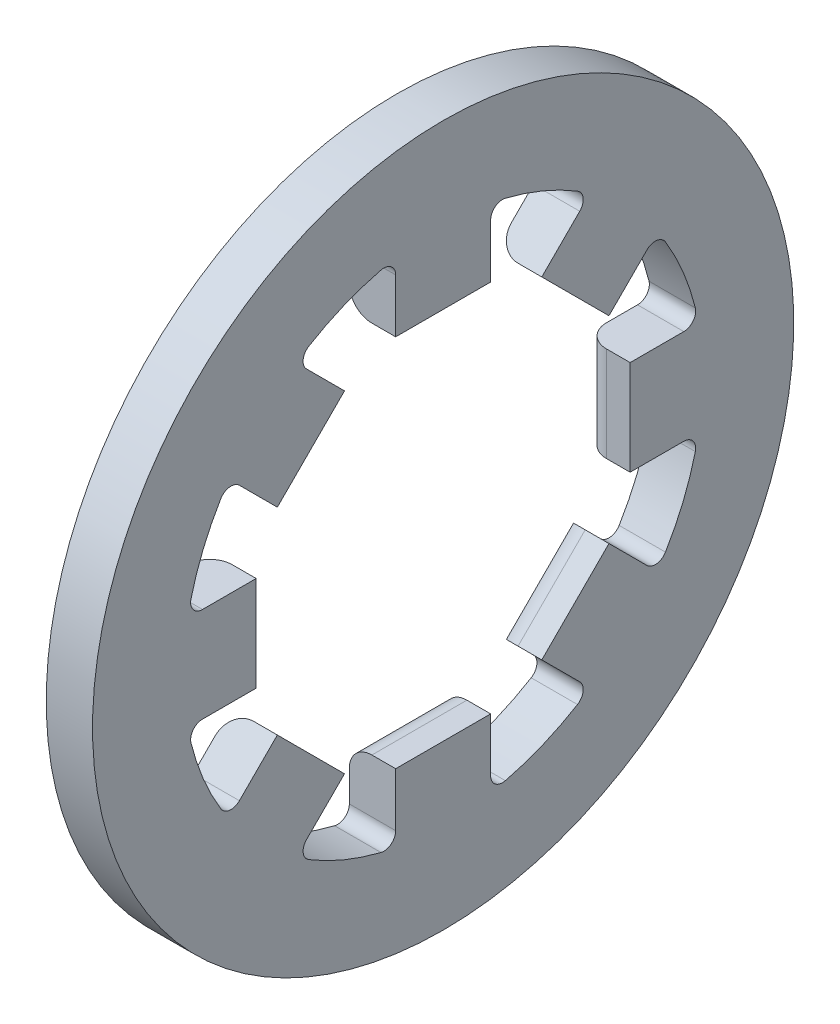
ISO-10303-21;
HEADER;
FILE_DESCRIPTION(('STEP AP214'),'2;1');
FILE_NAME('part.step','',(''),(''),'','','');
FILE_SCHEMA(('AUTOMOTIVE_DESIGN { 1 0 10303 214 1 1 1 1 }'));
ENDSEC;
DATA;
#1=APPLICATION_CONTEXT('core data for automotive mechanical design processes');
#2=APPLICATION_PROTOCOL_DEFINITION('international standard','automotive_design',2000,#1);
#3=PRODUCT_CONTEXT('',#1,'mechanical');
#4=PRODUCT('Part','Part','',(#3));
#5=PRODUCT_RELATED_PRODUCT_CATEGORY('part','',(#4));
#6=PRODUCT_DEFINITION_FORMATION('','',#4);
#7=PRODUCT_DEFINITION_CONTEXT('part definition',#1,'design');
#8=PRODUCT_DEFINITION('design','',#6,#7);
#9=PRODUCT_DEFINITION_SHAPE('','',#8);
#10=(LENGTH_UNIT() NAMED_UNIT(*) SI_UNIT(.MILLI.,.METRE.));
#11=(NAMED_UNIT(*) PLANE_ANGLE_UNIT() SI_UNIT($,.RADIAN.));
#12=(NAMED_UNIT(*) SI_UNIT($,.STERADIAN.) SOLID_ANGLE_UNIT());
#13=UNCERTAINTY_MEASURE_WITH_UNIT(LENGTH_MEASURE(1.E-05),#10,'distance_accuracy_value','');
#14=(GEOMETRIC_REPRESENTATION_CONTEXT(3) GLOBAL_UNCERTAINTY_ASSIGNED_CONTEXT((#13)) GLOBAL_UNIT_ASSIGNED_CONTEXT((#10,
#11,#12)) REPRESENTATION_CONTEXT('',''));
#15=CARTESIAN_POINT('',(0.,0.,0.));
#16=DIRECTION('',(0.,0.,1.));
#17=DIRECTION('',(1.,0.,0.));
#18=AXIS2_PLACEMENT_3D('',#15,#16,#17);
#19=CARTESIAN_POINT('',(258.953,-110.200094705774,367.61387270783));
#20=DIRECTION('',(0.,-0.707106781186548,0.707106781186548));
#21=DIRECTION('',(0.,-0.707106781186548,-0.707106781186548));
#22=AXIS2_PLACEMENT_3D('',#19,#20,#21);
#23=CYLINDRICAL_SURFACE('',#22,0.4826);
#24=CARTESIAN_POINT('',(258.953,-109.481674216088,366.895452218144));
#25=DIRECTION('',(0.,0.707106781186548,-0.707106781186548));
#26=DIRECTION('',(0.,-0.707106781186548,-0.707106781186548));
#27=AXIS2_PLACEMENT_3D('',#24,#25,#26);
#28=CIRCLE('',#27,0.4826);
#29=CARTESIAN_POINT('',(258.4704,-109.481674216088,366.895452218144));
#30=VERTEX_POINT('',#29);
#31=CARTESIAN_POINT('',(258.953,-109.140424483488,367.236701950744));
#32=VERTEX_POINT('',#31);
#33=EDGE_CURVE('E965',#30,#32,#28,.T.);
#34=ORIENTED_EDGE('',*,*,#33,.F.);
#35=DIRECTION('',(0.,0.707106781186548,-0.707106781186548));
#36=VECTOR('',#35,1.);
#37=CARTESIAN_POINT('',(258.4704,-110.200094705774,367.61387270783));
#38=LINE('',#37,#36);
#39=CARTESIAN_POINT('',(258.4704,-110.918515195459,368.332293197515));
#40=VERTEX_POINT('',#39);
#41=EDGE_CURVE('E721',#40,#30,#38,.T.);
#42=ORIENTED_EDGE('',*,*,#41,.F.);
#43=CARTESIAN_POINT('',(258.953,-110.918515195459,368.332293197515));
#44=DIRECTION('',(0.,-0.707106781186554,0.707106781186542));
#45=DIRECTION('',(0.,-0.707106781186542,-0.707106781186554));
#46=AXIS2_PLACEMENT_3D('',#43,#44,#45);
#47=CIRCLE('',#46,0.4826);
#48=CARTESIAN_POINT('',(258.953,-110.577265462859,368.673542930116));
#49=VERTEX_POINT('',#48);
#50=EDGE_CURVE('E955',#49,#40,#47,.T.);
#51=ORIENTED_EDGE('',*,*,#50,.F.);
#52=DIRECTION('',(0.,-0.707106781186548,0.707106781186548));
#53=VECTOR('',#52,1.);
#54=CARTESIAN_POINT('',(258.953,-109.858844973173,367.95512244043));
#55=LINE('',#54,#53);
#56=EDGE_CURVE('E990',#32,#49,#55,.T.);
#57=ORIENTED_EDGE('',*,*,#56,.F.);
#58=EDGE_LOOP('',(#34,#42,#51,#57));
#59=FACE_BOUND('',#58,.T.);
#60=ADVANCED_FACE('F17',(#59),#23,.T.);
#61=CARTESIAN_POINT('',(258.953,-111.513017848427,370.783549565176));
#62=DIRECTION('',(0.,0.,1.));
#63=DIRECTION('',(1.,0.,0.));
#64=AXIS2_PLACEMENT_3D('',#61,#62,#63);
#65=CYLINDRICAL_SURFACE('',#64,0.4826);
#66=CARTESIAN_POINT('',(258.953,-111.513017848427,369.767549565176));
#67=DIRECTION('',(0.,0.,-1.));
#68=DIRECTION('',(1.,0.,0.));
#69=AXIS2_PLACEMENT_3D('',#66,#67,#68);
#70=CIRCLE('',#69,0.4826);
#71=CARTESIAN_POINT('',(258.4704,-111.513017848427,369.767549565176));
#72=VERTEX_POINT('',#71);
#73=CARTESIAN_POINT('',(258.953,-111.030417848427,369.767549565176));
#74=VERTEX_POINT('',#73);
#75=EDGE_CURVE('E481',#72,#74,#70,.T.);
#76=ORIENTED_EDGE('',*,*,#75,.F.);
#77=DIRECTION('',(0.,0.,-1.));
#78=VECTOR('',#77,1.);
#79=CARTESIAN_POINT('',(258.4704,-111.513017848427,370.783549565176));
#80=LINE('',#79,#78);
#81=CARTESIAN_POINT('',(258.4704,-111.513017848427,371.799549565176));
#82=VERTEX_POINT('',#81);
#83=EDGE_CURVE('E718',#82,#72,#80,.T.);
#84=ORIENTED_EDGE('',*,*,#83,.F.);
#85=CARTESIAN_POINT('',(258.953,-111.513017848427,371.799549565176));
#86=DIRECTION('',(0.,0.,1.));
#87=DIRECTION('',(1.,0.,0.));
#88=AXIS2_PLACEMENT_3D('',#85,#86,#87);
#89=CIRCLE('',#88,0.4826);
#90=CARTESIAN_POINT('',(258.953,-111.030417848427,371.799549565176));
#91=VERTEX_POINT('',#90);
#92=EDGE_CURVE('E857',#91,#82,#89,.T.);
#93=ORIENTED_EDGE('',*,*,#92,.F.);
#94=DIRECTION('',(0.,0.,1.));
#95=VECTOR('',#94,1.);
#96=CARTESIAN_POINT('',(258.953,-111.030417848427,370.783549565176));
#97=LINE('',#96,#95);
#98=EDGE_CURVE('E485',#74,#91,#97,.T.);
#99=ORIENTED_EDGE('',*,*,#98,.F.);
#100=EDGE_LOOP('',(#76,#84,#93,#99));
#101=FACE_BOUND('',#100,.T.);
#102=ADVANCED_FACE('F1345',(#101),#65,.T.);
#103=CARTESIAN_POINT('',(258.953,-107.030417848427,366.300949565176));
#104=DIRECTION('',(0.,-1.,0.));
#105=DIRECTION('',(1.,0.,0.));
#106=AXIS2_PLACEMENT_3D('',#103,#104,#105);
#107=CYLINDRICAL_SURFACE('',#106,0.4826);
#108=CARTESIAN_POINT('',(258.953,-106.014417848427,366.300949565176));
#109=DIRECTION('',(0.,1.,0.));
#110=DIRECTION('',(1.,0.,0.));
#111=AXIS2_PLACEMENT_3D('',#108,#109,#110);
#112=CIRCLE('',#111,0.4826);
#113=CARTESIAN_POINT('',(258.4704,-106.014417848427,366.300949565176));
#114=VERTEX_POINT('',#113);
#115=CARTESIAN_POINT('',(258.953,-106.014417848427,366.783549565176));
#116=VERTEX_POINT('',#115);
#117=EDGE_CURVE('E887',#114,#116,#112,.T.);
#118=ORIENTED_EDGE('',*,*,#117,.F.);
#119=DIRECTION('',(0.,1.,0.));
#120=VECTOR('',#119,1.);
#121=CARTESIAN_POINT('',(258.4704,-107.030417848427,366.300949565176));
#122=LINE('',#121,#120);
#123=CARTESIAN_POINT('',(258.4704,-108.046417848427,366.300949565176));
#124=VERTEX_POINT('',#123);
#125=EDGE_CURVE('E724',#124,#114,#122,.T.);
#126=ORIENTED_EDGE('',*,*,#125,.F.);
#127=CARTESIAN_POINT('',(258.953,-108.046417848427,366.300949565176));
#128=DIRECTION('',(0.,-1.,0.));
#129=DIRECTION('',(1.,0.,0.));
#130=AXIS2_PLACEMENT_3D('',#127,#128,#129);
#131=CIRCLE('',#130,0.4826);
#132=CARTESIAN_POINT('',(258.953,-108.046417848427,366.783549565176));
#133=VERTEX_POINT('',#132);
#134=EDGE_CURVE('E835',#133,#124,#131,.T.);
#135=ORIENTED_EDGE('',*,*,#134,.F.);
#136=DIRECTION('',(0.,-1.,0.));
#137=VECTOR('',#136,1.);
#138=CARTESIAN_POINT('',(258.953,-107.030417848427,366.783549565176));
#139=LINE('',#138,#137);
#140=EDGE_CURVE('E883',#116,#133,#139,.T.);
#141=ORIENTED_EDGE('',*,*,#140,.F.);
#142=EDGE_LOOP('',(#118,#126,#135,#141));
#143=FACE_BOUND('',#142,.T.);
#144=ADVANCED_FACE('F1059',(#143),#107,.T.);
#145=CARTESIAN_POINT('',(258.953,-103.86074099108,367.61387270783));
#146=DIRECTION('',(0.,-0.707106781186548,-0.707106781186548));
#147=DIRECTION('',(0.,0.707106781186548,-0.707106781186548));
#148=AXIS2_PLACEMENT_3D('',#145,#146,#147);
#149=CYLINDRICAL_SURFACE('',#148,0.4826);
#150=CARTESIAN_POINT('',(258.953,-103.142320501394,368.332293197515));
#151=DIRECTION('',(0.,0.707106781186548,0.707106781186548));
#152=DIRECTION('',(0.,0.707106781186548,-0.707106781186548));
#153=AXIS2_PLACEMENT_3D('',#150,#151,#152);
#154=CIRCLE('',#153,0.4826);
#155=CARTESIAN_POINT('',(258.4704,-103.142320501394,368.332293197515));
#156=VERTEX_POINT('',#155);
#157=CARTESIAN_POINT('',(258.953,-103.483570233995,368.673542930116));
#158=VERTEX_POINT('',#157);
#159=EDGE_CURVE('E1268',#156,#158,#154,.T.);
#160=ORIENTED_EDGE('',*,*,#159,.F.);
#161=DIRECTION('',(0.,0.707106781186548,0.707106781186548));
#162=VECTOR('',#161,1.);
#163=CARTESIAN_POINT('',(258.4704,-103.86074099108,367.61387270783));
#164=LINE('',#163,#162);
#165=CARTESIAN_POINT('',(258.4704,-104.579161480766,366.895452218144));
#166=VERTEX_POINT('',#165);
#167=EDGE_CURVE('E727',#166,#156,#164,.T.);
#168=ORIENTED_EDGE('',*,*,#167,.F.);
#169=CARTESIAN_POINT('',(258.953,-104.579161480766,366.895452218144));
#170=DIRECTION('',(0.,-0.707106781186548,-0.707106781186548));
#171=DIRECTION('',(0.,0.707106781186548,-0.707106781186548));
#172=AXIS2_PLACEMENT_3D('',#169,#170,#171);
#173=CIRCLE('',#172,0.4826);
#174=CARTESIAN_POINT('',(258.953,-104.920411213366,367.236701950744));
#175=VERTEX_POINT('',#174);
#176=EDGE_CURVE('E796',#175,#166,#173,.T.);
#177=ORIENTED_EDGE('',*,*,#176,.F.);
#178=DIRECTION('',(0.,-0.707106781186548,-0.707106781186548));
#179=VECTOR('',#178,1.);
#180=CARTESIAN_POINT('',(258.953,-104.201990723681,367.95512244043));
#181=LINE('',#180,#179);
#182=EDGE_CURVE('E791',#158,#175,#181,.T.);
#183=ORIENTED_EDGE('',*,*,#182,.F.);
#184=EDGE_LOOP('',(#160,#168,#177,#183));
#185=FACE_BOUND('',#184,.T.);
#186=ADVANCED_FACE('F1237',(#185),#149,.T.);
#187=CARTESIAN_POINT('',(258.953,-102.547817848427,370.783549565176));
#188=DIRECTION('',(0.,0.,-1.));
#189=DIRECTION('',(-1.,0.,0.));
#190=AXIS2_PLACEMENT_3D('',#187,#188,#189);
#191=CYLINDRICAL_SURFACE('',#190,0.4826);
#192=CARTESIAN_POINT('',(258.953,-102.547817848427,371.799549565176));
#193=DIRECTION('',(0.,0.,1.));
#194=DIRECTION('',(-1.,0.,0.));
#195=AXIS2_PLACEMENT_3D('',#192,#193,#194);
#196=CIRCLE('',#195,0.4826);
#197=CARTESIAN_POINT('',(258.4704,-102.547817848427,371.799549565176));
#198=VERTEX_POINT('',#197);
#199=CARTESIAN_POINT('',(258.953,-103.030417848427,371.799549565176));
#200=VERTEX_POINT('',#199);
#201=EDGE_CURVE('E667',#198,#200,#196,.T.);
#202=ORIENTED_EDGE('',*,*,#201,.F.);
#203=DIRECTION('',(0.,0.,1.));
#204=VECTOR('',#203,1.);
#205=CARTESIAN_POINT('',(258.4704,-102.547817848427,370.783549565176));
#206=LINE('',#205,#204);
#207=CARTESIAN_POINT('',(258.4704,-102.547817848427,369.767549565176));
#208=VERTEX_POINT('',#207);
#209=EDGE_CURVE('E20',#208,#198,#206,.T.);
#210=ORIENTED_EDGE('',*,*,#209,.F.);
#211=CARTESIAN_POINT('',(258.953,-102.547817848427,369.767549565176));
#212=DIRECTION('',(0.,0.,-1.));
#213=DIRECTION('',(-1.,0.,0.));
#214=AXIS2_PLACEMENT_3D('',#211,#212,#213);
#215=CIRCLE('',#214,0.4826);
#216=CARTESIAN_POINT('',(258.953,-103.030417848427,369.767549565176));
#217=VERTEX_POINT('',#216);
#218=EDGE_CURVE('E690',#217,#208,#215,.T.);
#219=ORIENTED_EDGE('',*,*,#218,.F.);
#220=DIRECTION('',(0.,0.,-1.));
#221=VECTOR('',#220,1.);
#222=CARTESIAN_POINT('',(258.953,-103.030417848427,370.783549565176));
#223=LINE('',#222,#221);
#224=EDGE_CURVE('E679',#200,#217,#223,.T.);
#225=ORIENTED_EDGE('',*,*,#224,.F.);
#226=EDGE_LOOP('',(#202,#210,#219,#225));
#227=FACE_BOUND('',#226,.T.);
#228=ADVANCED_FACE('F745',(#227),#191,.T.);
#229=CARTESIAN_POINT('',(258.953,-110.200094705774,373.953226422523));
#230=DIRECTION('',(0.,0.707106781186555,0.707106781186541));
#231=DIRECTION('',(0.,-0.707106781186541,0.707106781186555));
#232=AXIS2_PLACEMENT_3D('',#229,#230,#231);
#233=CYLINDRICAL_SURFACE('',#232,0.4826);
#234=CARTESIAN_POINT('',(258.953,-110.918515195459,373.234805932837));
#235=DIRECTION('',(0.,-0.707106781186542,-0.707106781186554));
#236=DIRECTION('',(0.,-0.707106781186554,0.707106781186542));
#237=AXIS2_PLACEMENT_3D('',#234,#235,#236);
#238=CIRCLE('',#237,0.4826);
#239=CARTESIAN_POINT('',(258.4704,-110.918515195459,373.234805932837));
#240=VERTEX_POINT('',#239);
#241=CARTESIAN_POINT('',(258.953,-110.577265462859,372.893556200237));
#242=VERTEX_POINT('',#241);
#243=EDGE_CURVE('E531',#240,#242,#238,.T.);
#244=ORIENTED_EDGE('',*,*,#243,.F.);
#245=DIRECTION('',(0.,-0.707106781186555,-0.707106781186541));
#246=VECTOR('',#245,1.);
#247=CARTESIAN_POINT('',(258.4704,-110.200094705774,373.953226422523));
#248=LINE('',#247,#246);
#249=CARTESIAN_POINT('',(258.4704,-109.481674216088,374.671646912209));
#250=VERTEX_POINT('',#249);
#251=EDGE_CURVE('E620',#250,#240,#248,.T.);
#252=ORIENTED_EDGE('',*,*,#251,.F.);
#253=CARTESIAN_POINT('',(258.953,-109.481674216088,374.671646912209));
#254=DIRECTION('',(0.,0.707106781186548,0.707106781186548));
#255=DIRECTION('',(0.,-0.707106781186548,0.707106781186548));
#256=AXIS2_PLACEMENT_3D('',#253,#254,#255);
#257=CIRCLE('',#256,0.4826);
#258=CARTESIAN_POINT('',(258.953,-109.140424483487,374.330397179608));
#259=VERTEX_POINT('',#258);
#260=EDGE_CURVE('E475',#259,#250,#257,.T.);
#261=ORIENTED_EDGE('',*,*,#260,.F.);
#262=DIRECTION('',(0.,0.707106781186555,0.707106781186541));
#263=VECTOR('',#262,1.);
#264=CARTESIAN_POINT('',(258.953,-109.858844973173,373.611976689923));
#265=LINE('',#264,#263);
#266=EDGE_CURVE('E547',#242,#259,#265,.T.);
#267=ORIENTED_EDGE('',*,*,#266,.F.);
#268=EDGE_LOOP('',(#244,#252,#261,#267));
#269=FACE_BOUND('',#268,.T.);
#270=ADVANCED_FACE('F1435',(#269),#233,.T.);
#271=CARTESIAN_POINT('',(258.953,-103.86074099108,373.953226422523));
#272=DIRECTION('',(0.,0.707106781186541,-0.707106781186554));
#273=DIRECTION('',(0.,0.707106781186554,0.707106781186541));
#274=AXIS2_PLACEMENT_3D('',#271,#272,#273);
#275=CYLINDRICAL_SURFACE('',#274,0.4826);
#276=CARTESIAN_POINT('',(258.953,-104.579161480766,374.671646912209));
#277=DIRECTION('',(0.,-0.707106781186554,0.707106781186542));
#278=DIRECTION('',(0.,0.707106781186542,0.707106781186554));
#279=AXIS2_PLACEMENT_3D('',#276,#277,#278);
#280=CIRCLE('',#279,0.4826);
#281=CARTESIAN_POINT('',(258.4704,-104.579161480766,374.671646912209));
#282=VERTEX_POINT('',#281);
#283=CARTESIAN_POINT('',(258.953,-104.920411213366,374.330397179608));
#284=VERTEX_POINT('',#283);
#285=EDGE_CURVE('E623',#282,#284,#280,.T.);
#286=ORIENTED_EDGE('',*,*,#285,.F.);
#287=DIRECTION('',(0.,-0.707106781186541,0.707106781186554));
#288=VECTOR('',#287,1.);
#289=CARTESIAN_POINT('',(258.4704,-103.86074099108,373.953226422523));
#290=LINE('',#289,#288);
#291=CARTESIAN_POINT('',(258.4704,-103.142320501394,373.234805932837));
#292=VERTEX_POINT('',#291);
#293=EDGE_CURVE('E11',#292,#282,#290,.T.);
#294=ORIENTED_EDGE('',*,*,#293,.F.);
#295=CARTESIAN_POINT('',(258.953,-103.142320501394,373.234805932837));
#296=DIRECTION('',(0.,0.707106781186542,-0.707106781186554));
#297=DIRECTION('',(0.,0.707106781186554,0.707106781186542));
#298=AXIS2_PLACEMENT_3D('',#295,#296,#297);
#299=CIRCLE('',#298,0.4826);
#300=CARTESIAN_POINT('',(258.953,-103.483570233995,372.893556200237));
#301=VERTEX_POINT('',#300);
#302=EDGE_CURVE('E467',#301,#292,#299,.T.);
#303=ORIENTED_EDGE('',*,*,#302,.F.);
#304=DIRECTION('',(0.,0.707106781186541,-0.707106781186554));
#305=VECTOR('',#304,1.);
#306=CARTESIAN_POINT('',(258.953,-104.201990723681,373.611976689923));
#307=LINE('',#306,#305);
#308=EDGE_CURVE('E615',#284,#301,#307,.T.);
#309=ORIENTED_EDGE('',*,*,#308,.F.);
#310=EDGE_LOOP('',(#286,#294,#303,#309));
#311=FACE_BOUND('',#310,.T.);
#312=ADVANCED_FACE('F778',(#311),#275,.T.);
#313=CARTESIAN_POINT('',(258.953,-107.030417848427,375.266149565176));
#314=DIRECTION('',(0.,1.,0.));
#315=DIRECTION('',(-1.,0.,0.));
#316=AXIS2_PLACEMENT_3D('',#313,#314,#315);
#317=CYLINDRICAL_SURFACE('',#316,0.4826);
#318=CARTESIAN_POINT('',(258.953,-108.046417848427,375.266149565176));
#319=DIRECTION('',(0.,-1.,0.));
#320=DIRECTION('',(-1.,0.,0.));
#321=AXIS2_PLACEMENT_3D('',#318,#319,#320);
#322=CIRCLE('',#321,0.4826);
#323=CARTESIAN_POINT('',(258.4704,-108.046417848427,375.266149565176));
#324=VERTEX_POINT('',#323);
#325=CARTESIAN_POINT('',(258.953,-108.046417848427,374.783549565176));
#326=VERTEX_POINT('',#325);
#327=EDGE_CURVE('E506',#324,#326,#322,.T.);
#328=ORIENTED_EDGE('',*,*,#327,.F.);
#329=DIRECTION('',(0.,-1.,0.));
#330=VECTOR('',#329,1.);
#331=CARTESIAN_POINT('',(258.4704,-107.030417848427,375.266149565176));
#332=LINE('',#331,#330);
#333=CARTESIAN_POINT('',(258.4704,-106.014417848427,375.266149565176));
#334=VERTEX_POINT('',#333);
#335=EDGE_CURVE('E617',#334,#324,#332,.T.);
#336=ORIENTED_EDGE('',*,*,#335,.F.);
#337=CARTESIAN_POINT('',(258.953,-106.014417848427,375.266149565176));
#338=DIRECTION('',(0.,1.,0.));
#339=DIRECTION('',(-1.,0.,0.));
#340=AXIS2_PLACEMENT_3D('',#337,#338,#339);
#341=CIRCLE('',#340,0.4826);
#342=CARTESIAN_POINT('',(258.953,-106.014417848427,374.783549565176));
#343=VERTEX_POINT('',#342);
#344=EDGE_CURVE('E591',#343,#334,#341,.T.);
#345=ORIENTED_EDGE('',*,*,#344,.F.);
#346=DIRECTION('',(0.,1.,0.));
#347=VECTOR('',#346,1.);
#348=CARTESIAN_POINT('',(258.953,-107.030417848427,374.783549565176));
#349=LINE('',#348,#347);
#350=EDGE_CURVE('E583',#326,#343,#349,.T.);
#351=ORIENTED_EDGE('',*,*,#350,.F.);
#352=EDGE_LOOP('',(#328,#336,#345,#351));
#353=FACE_BOUND('',#352,.T.);
#354=ADVANCED_FACE('F1098',(#353),#317,.T.);
#355=CARTESIAN_POINT('',(258.4704,-107.030417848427,370.783549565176));
#356=DIRECTION('',(1.,0.,0.));
#357=DIRECTION('',(0.,1.,0.));
#358=AXIS2_PLACEMENT_3D('',#355,#356,#357);
#359=PLANE('',#358);
#360=CARTESIAN_POINT('',(258.4704,-107.030417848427,370.783549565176));
#361=DIRECTION('',(1.,0.,0.));
#362=DIRECTION('',(0.,1.,0.));
#363=AXIS2_PLACEMENT_3D('',#360,#361,#362);
#364=CIRCLE('',#363,7.5);
#365=CARTESIAN_POINT('',(258.4704,-99.530417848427,370.783549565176));
#366=VERTEX_POINT('',#365);
#367=EDGE_CURVE('E36',#366,#366,#364,.T.);
#368=ORIENTED_EDGE('',*,*,#367,.F.);
#369=EDGE_LOOP('',(#368));
#370=FACE_BOUND('',#369,.T.);
#371=DIRECTION('',(0.,0.,-1.));
#372=VECTOR('',#371,1.);
#373=CARTESIAN_POINT('',(258.4704,-106.014417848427,375.35750348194));
#374=LINE('',#373,#372);
#375=CARTESIAN_POINT('',(258.4704,-106.014417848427,375.931457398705));
#376=VERTEX_POINT('',#375);
#377=EDGE_CURVE('E595',#376,#334,#374,.T.);
#378=ORIENTED_EDGE('',*,*,#377,.T.);
#379=ORIENTED_EDGE('',*,*,#335,.T.);
#380=DIRECTION('',(0.,0.,-1.));
#381=VECTOR('',#380,1.);
#382=CARTESIAN_POINT('',(258.4704,-108.046417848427,375.35750348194));
#383=LINE('',#382,#381);
#384=CARTESIAN_POINT('',(258.4704,-108.046417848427,375.931457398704));
#385=VERTEX_POINT('',#384);
#386=EDGE_CURVE('E502',#385,#324,#383,.T.);
#387=ORIENTED_EDGE('',*,*,#386,.F.);
#388=CARTESIAN_POINT('',(258.4704,-108.300417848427,375.931457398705));
#389=DIRECTION('',(1.,0.,0.));
#390=DIRECTION('',(0.,1.,0.));
#391=AXIS2_PLACEMENT_3D('',#388,#389,#390);
#392=CIRCLE('',#391,0.253999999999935);
#393=CARTESIAN_POINT('',(258.4704,-108.36125617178,376.178063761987));
#394=VERTEX_POINT('',#393);
#395=EDGE_CURVE('E565',#385,#394,#392,.T.);
#396=ORIENTED_EDGE('',*,*,#395,.T.);
#397=CARTESIAN_POINT('',(258.4704,-107.030417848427,370.783549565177));
#398=DIRECTION('',(1.,0.,0.));
#399=DIRECTION('',(0.,1.,0.));
#400=AXIS2_PLACEMENT_3D('',#397,#398,#399);
#401=CIRCLE('',#400,5.55624999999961);
#402=CARTESIAN_POINT('',(258.4704,-109.903870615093,375.539091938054));
#403=VERTEX_POINT('',#402);
#404=EDGE_CURVE('E556',#394,#403,#401,.T.);
#405=ORIENTED_EDGE('',*,*,#404,.T.);
#406=CARTESIAN_POINT('',(258.4704,-109.772512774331,375.321695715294));
#407=DIRECTION('',(1.,0.,0.));
#408=DIRECTION('',(0.,1.,0.));
#409=AXIS2_PLACEMENT_3D('',#406,#407,#408);
#410=CIRCLE('',#409,0.253999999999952);
#411=CARTESIAN_POINT('',(258.4704,-109.952117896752,375.142090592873));
#412=VERTEX_POINT('',#411);
#413=EDGE_CURVE('E508',#403,#412,#410,.T.);
#414=ORIENTED_EDGE('',*,*,#413,.T.);
#415=DIRECTION('',(0.,0.707106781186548,-0.707106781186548));
#416=VECTOR('',#415,1.);
#417=CARTESIAN_POINT('',(258.4704,-109.54627119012,374.736243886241));
#418=LINE('',#417,#416);
#419=EDGE_CURVE('E470',#412,#250,#418,.T.);
#420=ORIENTED_EDGE('',*,*,#419,.T.);
#421=ORIENTED_EDGE('',*,*,#251,.T.);
#422=DIRECTION('',(0.,0.707106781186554,-0.707106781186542));
#423=VECTOR('',#422,1.);
#424=CARTESIAN_POINT('',(258.4704,-110.983112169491,373.29940290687));
#425=LINE('',#424,#423);
#426=CARTESIAN_POINT('',(258.4704,-111.388958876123,373.705249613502));
#427=VERTEX_POINT('',#426);
#428=EDGE_CURVE('E540',#427,#240,#425,.T.);
#429=ORIENTED_EDGE('',*,*,#428,.F.);
#430=CARTESIAN_POINT('',(258.4704,-111.568563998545,373.52564449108));
#431=DIRECTION('',(1.,0.,0.));
#432=DIRECTION('',(0.,1.,0.));
#433=AXIS2_PLACEMENT_3D('',#430,#431,#432);
#434=CIRCLE('',#433,0.254000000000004);
#435=CARTESIAN_POINT('',(258.4704,-111.785960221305,373.657002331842));
#436=VERTEX_POINT('',#435);
#437=EDGE_CURVE('E525',#427,#436,#434,.T.);
#438=ORIENTED_EDGE('',*,*,#437,.T.);
#439=CARTESIAN_POINT('',(258.4704,-107.030417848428,370.783549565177));
#440=DIRECTION('',(1.,0.,0.));
#441=DIRECTION('',(0.,1.,0.));
#442=AXIS2_PLACEMENT_3D('',#439,#440,#441);
#443=CIRCLE('',#442,5.55624999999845);
#444=CARTESIAN_POINT('',(258.4704,-112.424932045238,372.11438788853));
#445=VERTEX_POINT('',#444);
#446=EDGE_CURVE('E517',#436,#445,#443,.T.);
#447=ORIENTED_EDGE('',*,*,#446,.T.);
#448=CARTESIAN_POINT('',(258.4704,-112.178325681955,372.053549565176));
#449=DIRECTION('',(1.,0.,0.));
#450=DIRECTION('',(0.,1.,0.));
#451=AXIS2_PLACEMENT_3D('',#448,#449,#450);
#452=CIRCLE('',#451,0.253999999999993);
#453=CARTESIAN_POINT('',(258.4704,-112.178325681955,371.799549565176));
#454=VERTEX_POINT('',#453);
#455=EDGE_CURVE('E454',#445,#454,#452,.T.);
#456=ORIENTED_EDGE('',*,*,#455,.T.);
#457=DIRECTION('',(0.,1.,0.));
#458=VECTOR('',#457,1.);
#459=CARTESIAN_POINT('',(258.4704,-111.604371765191,371.799549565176));
#460=LINE('',#459,#458);
#461=EDGE_CURVE('E935',#454,#82,#460,.T.);
#462=ORIENTED_EDGE('',*,*,#461,.T.);
#463=ORIENTED_EDGE('',*,*,#83,.T.);
#464=DIRECTION('',(0.,1.,0.));
#465=VECTOR('',#464,1.);
#466=CARTESIAN_POINT('',(258.4704,-111.604371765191,369.767549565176));
#467=LINE('',#466,#465);
#468=CARTESIAN_POINT('',(258.4704,-112.178325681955,369.767549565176));
#469=VERTEX_POINT('',#468);
#470=EDGE_CURVE('E912',#469,#72,#467,.T.);
#471=ORIENTED_EDGE('',*,*,#470,.F.);
#472=CARTESIAN_POINT('',(258.4704,-112.178325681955,369.513549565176));
#473=DIRECTION('',(1.,0.,0.));
#474=DIRECTION('',(0.,1.,0.));
#475=AXIS2_PLACEMENT_3D('',#472,#473,#474);
#476=CIRCLE('',#475,0.253999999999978);
#477=CARTESIAN_POINT('',(258.4704,-112.424932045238,369.452711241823));
#478=VERTEX_POINT('',#477);
#479=EDGE_CURVE('E458',#469,#478,#476,.T.);
#480=ORIENTED_EDGE('',*,*,#479,.T.);
#481=CARTESIAN_POINT('',(258.4704,-107.030417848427,370.783549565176));
#482=DIRECTION('',(1.,0.,0.));
#483=DIRECTION('',(0.,1.,0.));
#484=AXIS2_PLACEMENT_3D('',#481,#482,#483);
#485=CIRCLE('',#484,5.55624999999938);
#486=CARTESIAN_POINT('',(258.4704,-111.785960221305,367.91009679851));
#487=VERTEX_POINT('',#486);
#488=EDGE_CURVE('E434',#478,#487,#485,.T.);
#489=ORIENTED_EDGE('',*,*,#488,.T.);
#490=CARTESIAN_POINT('',(258.4704,-111.568563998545,368.041454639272));
#491=DIRECTION('',(1.,0.,0.));
#492=DIRECTION('',(0.,1.,0.));
#493=AXIS2_PLACEMENT_3D('',#490,#491,#492);
#494=CIRCLE('',#493,0.254000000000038);
#495=CARTESIAN_POINT('',(258.4704,-111.388958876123,367.861849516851));
#496=VERTEX_POINT('',#495);
#497=EDGE_CURVE('E428',#487,#496,#494,.T.);
#498=ORIENTED_EDGE('',*,*,#497,.T.);
#499=DIRECTION('',(0.,0.707106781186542,0.707106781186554));
#500=VECTOR('',#499,1.);
#501=CARTESIAN_POINT('',(258.4704,-110.983112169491,368.267696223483));
#502=LINE('',#501,#500);
#503=EDGE_CURVE('E951',#496,#40,#502,.T.);
#504=ORIENTED_EDGE('',*,*,#503,.T.);
#505=ORIENTED_EDGE('',*,*,#41,.T.);
#506=DIRECTION('',(0.,0.707106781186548,0.707106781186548));
#507=VECTOR('',#506,1.);
#508=CARTESIAN_POINT('',(258.4704,-109.54627119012,366.830855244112));
#509=LINE('',#508,#507);
#510=CARTESIAN_POINT('',(258.4704,-109.952117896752,366.42500853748));
#511=VERTEX_POINT('',#510);
#512=EDGE_CURVE('E958',#511,#30,#509,.T.);
#513=ORIENTED_EDGE('',*,*,#512,.F.);
#514=CARTESIAN_POINT('',(258.4704,-109.772512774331,366.245403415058));
#515=DIRECTION('',(1.,0.,0.));
#516=DIRECTION('',(0.,1.,0.));
#517=AXIS2_PLACEMENT_3D('',#514,#515,#516);
#518=CIRCLE('',#517,0.253999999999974);
#519=CARTESIAN_POINT('',(258.4704,-109.903870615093,366.028007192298));
#520=VERTEX_POINT('',#519);
#521=EDGE_CURVE('E920',#511,#520,#518,.T.);
#522=ORIENTED_EDGE('',*,*,#521,.T.);
#523=CARTESIAN_POINT('',(258.4704,-107.030417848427,370.783549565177));
#524=DIRECTION('',(1.,0.,0.));
#525=DIRECTION('',(0.,1.,0.));
#526=AXIS2_PLACEMENT_3D('',#523,#524,#525);
#527=CIRCLE('',#526,5.55625000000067);
#528=CARTESIAN_POINT('',(258.4704,-108.36125617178,365.389035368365));
#529=VERTEX_POINT('',#528);
#530=EDGE_CURVE('E825',#520,#529,#527,.T.);
#531=ORIENTED_EDGE('',*,*,#530,.T.);
#532=CARTESIAN_POINT('',(258.4704,-108.300417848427,365.635641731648));
#533=DIRECTION('',(1.,0.,0.));
#534=DIRECTION('',(0.,1.,0.));
#535=AXIS2_PLACEMENT_3D('',#532,#533,#534);
#536=CIRCLE('',#535,0.254000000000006);
#537=CARTESIAN_POINT('',(258.4704,-108.046417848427,365.635641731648));
#538=VERTEX_POINT('',#537);
#539=EDGE_CURVE('E931',#529,#538,#536,.T.);
#540=ORIENTED_EDGE('',*,*,#539,.T.);
#541=DIRECTION('',(0.,0.,1.));
#542=VECTOR('',#541,1.);
#543=CARTESIAN_POINT('',(258.4704,-108.046417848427,366.209595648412));
#544=LINE('',#543,#542);
#545=EDGE_CURVE('E830',#538,#124,#544,.T.);
#546=ORIENTED_EDGE('',*,*,#545,.T.);
#547=ORIENTED_EDGE('',*,*,#125,.T.);
#548=DIRECTION('',(0.,0.,1.));
#549=VECTOR('',#548,1.);
#550=CARTESIAN_POINT('',(258.4704,-106.014417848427,366.209595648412));
#551=LINE('',#550,#549);
#552=CARTESIAN_POINT('',(258.4704,-106.014417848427,365.635641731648));
#553=VERTEX_POINT('',#552);
#554=EDGE_CURVE('E873',#553,#114,#551,.T.);
#555=ORIENTED_EDGE('',*,*,#554,.F.);
#556=CARTESIAN_POINT('',(258.4704,-105.760417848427,365.635641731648));
#557=DIRECTION('',(1.,0.,0.));
#558=DIRECTION('',(0.,1.,0.));
#559=AXIS2_PLACEMENT_3D('',#556,#557,#558);
#560=CIRCLE('',#559,0.254000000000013);
#561=CARTESIAN_POINT('',(258.4704,-105.699579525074,365.389035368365));
#562=VERTEX_POINT('',#561);
#563=EDGE_CURVE('E853',#553,#562,#560,.T.);
#564=ORIENTED_EDGE('',*,*,#563,.T.);
#565=CARTESIAN_POINT('',(258.4704,-107.030417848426,370.783549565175));
#566=DIRECTION('',(1.,0.,0.));
#567=DIRECTION('',(0.,1.,0.));
#568=AXIS2_PLACEMENT_3D('',#565,#566,#567);
#569=CIRCLE('',#568,5.55624999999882);
#570=CARTESIAN_POINT('',(258.4704,-104.156965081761,366.028007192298));
#571=VERTEX_POINT('',#570);
#572=EDGE_CURVE('E805',#562,#571,#569,.T.);
#573=ORIENTED_EDGE('',*,*,#572,.T.);
#574=CARTESIAN_POINT('',(258.4704,-104.288322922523,366.245403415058));
#575=DIRECTION('',(1.,0.,0.));
#576=DIRECTION('',(0.,1.,0.));
#577=AXIS2_PLACEMENT_3D('',#574,#575,#576);
#578=CIRCLE('',#577,0.25399999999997);
#579=CARTESIAN_POINT('',(258.4704,-104.108717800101,366.42500853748));
#580=VERTEX_POINT('',#579);
#581=EDGE_CURVE('E820',#571,#580,#578,.T.);
#582=ORIENTED_EDGE('',*,*,#581,.T.);
#583=DIRECTION('',(0.,-0.707106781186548,0.707106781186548));
#584=VECTOR('',#583,1.);
#585=CARTESIAN_POINT('',(258.4704,-104.514564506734,366.830855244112));
#586=LINE('',#585,#584);
#587=EDGE_CURVE('E798',#580,#166,#586,.T.);
#588=ORIENTED_EDGE('',*,*,#587,.T.);
#589=ORIENTED_EDGE('',*,*,#167,.T.);
#590=DIRECTION('',(0.,-0.707106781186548,0.707106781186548));
#591=VECTOR('',#590,1.);
#592=CARTESIAN_POINT('',(258.4704,-103.077723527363,368.267696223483));
#593=LINE('',#592,#591);
#594=CARTESIAN_POINT('',(258.4704,-102.67187682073,367.861849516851));
#595=VERTEX_POINT('',#594);
#596=EDGE_CURVE('E1262',#595,#156,#593,.T.);
#597=ORIENTED_EDGE('',*,*,#596,.F.);
#598=CARTESIAN_POINT('',(258.4704,-102.492271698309,368.041454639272));
#599=DIRECTION('',(1.,0.,0.));
#600=DIRECTION('',(0.,1.,0.));
#601=AXIS2_PLACEMENT_3D('',#598,#599,#600);
#602=CIRCLE('',#601,0.253999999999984);
#603=CARTESIAN_POINT('',(258.4704,-102.274875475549,367.91009679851));
#604=VERTEX_POINT('',#603);
#605=EDGE_CURVE('E391',#595,#604,#602,.T.);
#606=ORIENTED_EDGE('',*,*,#605,.T.);
#607=CARTESIAN_POINT('',(258.4704,-107.030417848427,370.783549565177));
#608=DIRECTION('',(1.,0.,0.));
#609=DIRECTION('',(0.,1.,0.));
#610=AXIS2_PLACEMENT_3D('',#607,#608,#609);
#611=CIRCLE('',#610,5.55625000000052);
#612=CARTESIAN_POINT('',(258.4704,-101.635903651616,369.452711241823));
#613=VERTEX_POINT('',#612);
#614=EDGE_CURVE('E403',#604,#613,#611,.T.);
#615=ORIENTED_EDGE('',*,*,#614,.T.);
#616=CARTESIAN_POINT('',(258.4704,-101.882510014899,369.513549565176));
#617=DIRECTION('',(1.,0.,0.));
#618=DIRECTION('',(0.,1.,0.));
#619=AXIS2_PLACEMENT_3D('',#616,#617,#618);
#620=CIRCLE('',#619,0.254000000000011);
#621=CARTESIAN_POINT('',(258.4704,-101.882510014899,369.767549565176));
#622=VERTEX_POINT('',#621);
#623=EDGE_CURVE('E406',#613,#622,#620,.T.);
#624=ORIENTED_EDGE('',*,*,#623,.T.);
#625=DIRECTION('',(0.,-1.,0.));
#626=VECTOR('',#625,1.);
#627=CARTESIAN_POINT('',(258.4704,-102.456463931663,369.767549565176));
#628=LINE('',#627,#626);
#629=EDGE_CURVE('E694',#622,#208,#628,.T.);
#630=ORIENTED_EDGE('',*,*,#629,.T.);
#631=ORIENTED_EDGE('',*,*,#209,.T.);
#632=DIRECTION('',(0.,-1.,0.));
#633=VECTOR('',#632,1.);
#634=CARTESIAN_POINT('',(258.4704,-102.456463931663,371.799549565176));
#635=LINE('',#634,#633);
#636=CARTESIAN_POINT('',(258.4704,-101.882510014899,371.799549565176));
#637=VERTEX_POINT('',#636);
#638=EDGE_CURVE('E657',#637,#198,#635,.T.);
#639=ORIENTED_EDGE('',*,*,#638,.F.);
#640=CARTESIAN_POINT('',(258.4704,-101.882510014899,372.053549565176));
#641=DIRECTION('',(1.,0.,0.));
#642=DIRECTION('',(0.,1.,0.));
#643=AXIS2_PLACEMENT_3D('',#640,#641,#642);
#644=CIRCLE('',#643,0.253999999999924);
#645=CARTESIAN_POINT('',(258.4704,-101.635903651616,372.11438788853));
#646=VERTEX_POINT('',#645);
#647=EDGE_CURVE('E661',#637,#646,#644,.T.);
#648=ORIENTED_EDGE('',*,*,#647,.T.);
#649=CARTESIAN_POINT('',(258.4704,-107.030417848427,370.783549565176));
#650=DIRECTION('',(1.,0.,0.));
#651=DIRECTION('',(0.,1.,0.));
#652=AXIS2_PLACEMENT_3D('',#649,#650,#651);
#653=CIRCLE('',#652,5.55624999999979);
#654=CARTESIAN_POINT('',(258.4704,-102.274875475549,373.657002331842));
#655=VERTEX_POINT('',#654);
#656=EDGE_CURVE('E501',#646,#655,#653,.T.);
#657=ORIENTED_EDGE('',*,*,#656,.T.);
#658=CARTESIAN_POINT('',(258.4704,-102.492271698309,373.52564449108));
#659=DIRECTION('',(1.,0.,0.));
#660=DIRECTION('',(0.,1.,0.));
#661=AXIS2_PLACEMENT_3D('',#658,#659,#660);
#662=CIRCLE('',#661,0.253999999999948);
#663=CARTESIAN_POINT('',(258.4704,-102.67187682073,373.705249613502));
#664=VERTEX_POINT('',#663);
#665=EDGE_CURVE('E445',#655,#664,#662,.T.);
#666=ORIENTED_EDGE('',*,*,#665,.T.);
#667=DIRECTION('',(0.,-0.707106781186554,-0.707106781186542));
#668=VECTOR('',#667,1.);
#669=CARTESIAN_POINT('',(258.4704,-103.077723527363,373.299402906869));
#670=LINE('',#669,#668);
#671=EDGE_CURVE('E636',#664,#292,#670,.T.);
#672=ORIENTED_EDGE('',*,*,#671,.T.);
#673=ORIENTED_EDGE('',*,*,#293,.T.);
#674=DIRECTION('',(0.,-0.707106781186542,-0.707106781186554));
#675=VECTOR('',#674,1.);
#676=CARTESIAN_POINT('',(258.4704,-104.514564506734,374.736243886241));
#677=LINE('',#676,#675);
#678=CARTESIAN_POINT('',(258.4704,-104.108717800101,375.142090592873));
#679=VERTEX_POINT('',#678);
#680=EDGE_CURVE('E443',#679,#282,#677,.T.);
#681=ORIENTED_EDGE('',*,*,#680,.F.);
#682=CARTESIAN_POINT('',(258.4704,-104.288322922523,375.321695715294));
#683=DIRECTION('',(1.,0.,0.));
#684=DIRECTION('',(0.,1.,0.));
#685=AXIS2_PLACEMENT_3D('',#682,#683,#684);
#686=CIRCLE('',#685,0.253999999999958);
#687=CARTESIAN_POINT('',(258.4704,-104.156965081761,375.539091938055));
#688=VERTEX_POINT('',#687);
#689=EDGE_CURVE('E610',#679,#688,#686,.T.);
#690=ORIENTED_EDGE('',*,*,#689,.T.);
#691=CARTESIAN_POINT('',(258.4704,-107.030417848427,370.783549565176));
#692=DIRECTION('',(1.,0.,0.));
#693=DIRECTION('',(0.,1.,0.));
#694=AXIS2_PLACEMENT_3D('',#691,#692,#693);
#695=CIRCLE('',#694,5.55625000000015);
#696=CARTESIAN_POINT('',(258.4704,-105.699579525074,376.178063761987));
#697=VERTEX_POINT('',#696);
#698=EDGE_CURVE('E486',#688,#697,#695,.T.);
#699=ORIENTED_EDGE('',*,*,#698,.T.);
#700=CARTESIAN_POINT('',(258.4704,-105.760417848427,375.931457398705));
#701=DIRECTION('',(1.,0.,0.));
#702=DIRECTION('',(0.,1.,0.));
#703=AXIS2_PLACEMENT_3D('',#700,#701,#702);
#704=CIRCLE('',#703,0.253999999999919);
#705=EDGE_CURVE('E422',#697,#376,#704,.T.);
#706=ORIENTED_EDGE('',*,*,#705,.T.);
#707=EDGE_LOOP('',(#378,#379,#387,#396,#405,#414,#420,#421,#429,#438,#447,#456,#462,#463,#471,
#480,#489,#498,#504,#505,#513,#522,#531,#540,#546,#547,#555,#564,#573,#582,#588,#589,#597,#606,
#615,#624,#630,#631,#639,#648,#657,#666,#672,#673,#681,#690,#699,#706));
#708=FACE_BOUND('',#707,.T.);
#709=ADVANCED_FACE('F741',(#370,#708),#359,.F.);
#710=CARTESIAN_POINT('',(259.461,-107.030417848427,370.783549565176));
#711=DIRECTION('',(1.,0.,0.));
#712=DIRECTION('',(0.,1.,0.));
#713=AXIS2_PLACEMENT_3D('',#710,#711,#712);
#714=PLANE('',#713);
#715=CARTESIAN_POINT('',(259.461,-107.030417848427,370.783549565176));
#716=DIRECTION('',(1.,0.,0.));
#717=DIRECTION('',(0.,1.,0.));
#718=AXIS2_PLACEMENT_3D('',#715,#716,#717);
#719=CIRCLE('',#718,7.5);
#720=CARTESIAN_POINT('',(259.461,-99.530417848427,370.783549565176));
#721=VERTEX_POINT('',#720);
#722=EDGE_CURVE('E46',#721,#721,#719,.T.);
#723=ORIENTED_EDGE('',*,*,#722,.T.);
#724=EDGE_LOOP('',(#723));
#725=FACE_BOUND('',#724,.T.);
#726=DIRECTION('',(0.,-0.707106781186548,0.707106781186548));
#727=VECTOR('',#726,1.);
#728=CARTESIAN_POINT('',(259.461,-103.077723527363,368.267696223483));
#729=LINE('',#728,#727);
#730=CARTESIAN_POINT('',(259.461,-102.67187682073,367.861849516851));
#731=VERTEX_POINT('',#730);
#732=CARTESIAN_POINT('',(259.461,-103.483570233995,368.673542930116));
#733=VERTEX_POINT('',#732);
#734=EDGE_CURVE('E1264',#731,#733,#729,.T.);
#735=ORIENTED_EDGE('',*,*,#734,.T.);
#736=DIRECTION('',(0.,-0.707106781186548,-0.707106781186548));
#737=VECTOR('',#736,1.);
#738=CARTESIAN_POINT('',(259.461,-104.201990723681,367.95512244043));
#739=LINE('',#738,#737);
#740=CARTESIAN_POINT('',(259.461,-104.920411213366,367.236701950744));
#741=VERTEX_POINT('',#740);
#742=EDGE_CURVE('E793',#733,#741,#739,.T.);
#743=ORIENTED_EDGE('',*,*,#742,.T.);
#744=DIRECTION('',(0.,-0.707106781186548,0.707106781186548));
#745=VECTOR('',#744,1.);
#746=CARTESIAN_POINT('',(259.461,-104.514564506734,366.830855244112));
#747=LINE('',#746,#745);
#748=CARTESIAN_POINT('',(259.461,-104.108717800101,366.42500853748));
#749=VERTEX_POINT('',#748);
#750=EDGE_CURVE('E816',#749,#741,#747,.T.);
#751=ORIENTED_EDGE('',*,*,#750,.F.);
#752=CARTESIAN_POINT('',(259.461,-104.288322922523,366.245403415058));
#753=DIRECTION('',(1.,0.,0.));
#754=DIRECTION('',(0.,1.,0.));
#755=AXIS2_PLACEMENT_3D('',#752,#753,#754);
#756=CIRCLE('',#755,0.25399999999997);
#757=CARTESIAN_POINT('',(259.461,-104.156965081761,366.028007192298));
#758=VERTEX_POINT('',#757);
#759=EDGE_CURVE('E810',#758,#749,#756,.T.);
#760=ORIENTED_EDGE('',*,*,#759,.F.);
#761=CARTESIAN_POINT('',(259.461,-107.030417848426,370.783549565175));
#762=DIRECTION('',(1.,0.,0.));
#763=DIRECTION('',(0.,1.,0.));
#764=AXIS2_PLACEMENT_3D('',#761,#762,#763);
#765=CIRCLE('',#764,5.55624999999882);
#766=CARTESIAN_POINT('',(259.461,-105.699579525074,365.389035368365));
#767=VERTEX_POINT('',#766);
#768=EDGE_CURVE('E849',#767,#758,#765,.T.);
#769=ORIENTED_EDGE('',*,*,#768,.F.);
#770=CARTESIAN_POINT('',(259.461,-105.760417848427,365.635641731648));
#771=DIRECTION('',(1.,0.,0.));
#772=DIRECTION('',(0.,1.,0.));
#773=AXIS2_PLACEMENT_3D('',#770,#771,#772);
#774=CIRCLE('',#773,0.254000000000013);
#775=CARTESIAN_POINT('',(259.461,-106.014417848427,365.635641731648));
#776=VERTEX_POINT('',#775);
#777=EDGE_CURVE('E865',#776,#767,#774,.T.);
#778=ORIENTED_EDGE('',*,*,#777,.F.);
#779=DIRECTION('',(0.,0.,1.));
#780=VECTOR('',#779,1.);
#781=CARTESIAN_POINT('',(259.461,-106.014417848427,366.209595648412));
#782=LINE('',#781,#780);
#783=CARTESIAN_POINT('',(259.461,-106.014417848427,366.783549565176));
#784=VERTEX_POINT('',#783);
#785=EDGE_CURVE('E897',#776,#784,#782,.T.);
#786=ORIENTED_EDGE('',*,*,#785,.T.);
#787=DIRECTION('',(0.,-1.,0.));
#788=VECTOR('',#787,1.);
#789=CARTESIAN_POINT('',(259.461,-107.030417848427,366.783549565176));
#790=LINE('',#789,#788);
#791=CARTESIAN_POINT('',(259.461,-108.046417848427,366.783549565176));
#792=VERTEX_POINT('',#791);
#793=EDGE_CURVE('E882',#784,#792,#790,.T.);
#794=ORIENTED_EDGE('',*,*,#793,.T.);
#795=DIRECTION('',(0.,0.,1.));
#796=VECTOR('',#795,1.);
#797=CARTESIAN_POINT('',(259.461,-108.046417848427,366.209595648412));
#798=LINE('',#797,#796);
#799=CARTESIAN_POINT('',(259.461,-108.046417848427,365.635641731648));
#800=VERTEX_POINT('',#799);
#801=EDGE_CURVE('E877',#800,#792,#798,.T.);
#802=ORIENTED_EDGE('',*,*,#801,.F.);
#803=CARTESIAN_POINT('',(259.461,-108.300417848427,365.635641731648));
#804=DIRECTION('',(1.,0.,0.));
#805=DIRECTION('',(0.,1.,0.));
#806=AXIS2_PLACEMENT_3D('',#803,#804,#805);
#807=CIRCLE('',#806,0.254000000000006);
#808=CARTESIAN_POINT('',(259.461,-108.36125617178,365.389035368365));
#809=VERTEX_POINT('',#808);
#810=EDGE_CURVE('E829',#809,#800,#807,.T.);
#811=ORIENTED_EDGE('',*,*,#810,.F.);
#812=CARTESIAN_POINT('',(259.461,-107.030417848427,370.783549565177));
#813=DIRECTION('',(1.,0.,0.));
#814=DIRECTION('',(0.,1.,0.));
#815=AXIS2_PLACEMENT_3D('',#812,#813,#814);
#816=CIRCLE('',#815,5.55625000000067);
#817=CARTESIAN_POINT('',(259.461,-109.903870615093,366.028007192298));
#818=VERTEX_POINT('',#817);
#819=EDGE_CURVE('E924',#818,#809,#816,.T.);
#820=ORIENTED_EDGE('',*,*,#819,.F.);
#821=CARTESIAN_POINT('',(259.461,-109.772512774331,366.245403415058));
#822=DIRECTION('',(1.,0.,0.));
#823=DIRECTION('',(0.,1.,0.));
#824=AXIS2_PLACEMENT_3D('',#821,#822,#823);
#825=CIRCLE('',#824,0.253999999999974);
#826=CARTESIAN_POINT('',(259.461,-109.952117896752,366.42500853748));
#827=VERTEX_POINT('',#826);
#828=EDGE_CURVE('E950',#827,#818,#825,.T.);
#829=ORIENTED_EDGE('',*,*,#828,.F.);
#830=DIRECTION('',(0.,0.707106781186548,0.707106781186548));
#831=VECTOR('',#830,1.);
#832=CARTESIAN_POINT('',(259.461,-109.54627119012,366.830855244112));
#833=LINE('',#832,#831);
#834=CARTESIAN_POINT('',(259.461,-109.140424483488,367.236701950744));
#835=VERTEX_POINT('',#834);
#836=EDGE_CURVE('E986',#827,#835,#833,.T.);
#837=ORIENTED_EDGE('',*,*,#836,.T.);
#838=DIRECTION('',(0.,-0.707106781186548,0.707106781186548));
#839=VECTOR('',#838,1.);
#840=CARTESIAN_POINT('',(259.461,-109.858844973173,367.95512244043));
#841=LINE('',#840,#839);
#842=CARTESIAN_POINT('',(259.461,-110.577265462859,368.673542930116));
#843=VERTEX_POINT('',#842);
#844=EDGE_CURVE('E1000',#835,#843,#841,.T.);
#845=ORIENTED_EDGE('',*,*,#844,.T.);
#846=DIRECTION('',(0.,0.707106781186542,0.707106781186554));
#847=VECTOR('',#846,1.);
#848=CARTESIAN_POINT('',(259.461,-110.983112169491,368.267696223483));
#849=LINE('',#848,#847);
#850=CARTESIAN_POINT('',(259.461,-111.388958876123,367.861849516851));
#851=VERTEX_POINT('',#850);
#852=EDGE_CURVE('E916',#851,#843,#849,.T.);
#853=ORIENTED_EDGE('',*,*,#852,.F.);
#854=CARTESIAN_POINT('',(259.461,-111.568563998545,368.041454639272));
#855=DIRECTION('',(1.,0.,0.));
#856=DIRECTION('',(0.,1.,0.));
#857=AXIS2_PLACEMENT_3D('',#854,#855,#856);
#858=CIRCLE('',#857,0.254000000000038);
#859=CARTESIAN_POINT('',(259.461,-111.785960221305,367.91009679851));
#860=VERTEX_POINT('',#859);
#861=EDGE_CURVE('E427',#860,#851,#858,.T.);
#862=ORIENTED_EDGE('',*,*,#861,.F.);
#863=CARTESIAN_POINT('',(259.461,-107.030417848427,370.783549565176));
#864=DIRECTION('',(1.,0.,0.));
#865=DIRECTION('',(0.,1.,0.));
#866=AXIS2_PLACEMENT_3D('',#863,#864,#865);
#867=CIRCLE('',#866,5.55624999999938);
#868=CARTESIAN_POINT('',(259.461,-112.424932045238,369.452711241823));
#869=VERTEX_POINT('',#868);
#870=EDGE_CURVE('E433',#869,#860,#867,.T.);
#871=ORIENTED_EDGE('',*,*,#870,.F.);
#872=CARTESIAN_POINT('',(259.461,-112.178325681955,369.513549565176));
#873=DIRECTION('',(1.,0.,0.));
#874=DIRECTION('',(0.,1.,0.));
#875=AXIS2_PLACEMENT_3D('',#872,#873,#874);
#876=CIRCLE('',#875,0.253999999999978);
#877=CARTESIAN_POINT('',(259.461,-112.178325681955,369.767549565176));
#878=VERTEX_POINT('',#877);
#879=EDGE_CURVE('E463',#878,#869,#876,.T.);
#880=ORIENTED_EDGE('',*,*,#879,.F.);
#881=DIRECTION('',(0.,1.,0.));
#882=VECTOR('',#881,1.);
#883=CARTESIAN_POINT('',(259.461,-111.604371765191,369.767549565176));
#884=LINE('',#883,#882);
#885=CARTESIAN_POINT('',(259.461,-111.030417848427,369.767549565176));
#886=VERTEX_POINT('',#885);
#887=EDGE_CURVE('E480',#878,#886,#884,.T.);
#888=ORIENTED_EDGE('',*,*,#887,.T.);
#889=DIRECTION('',(0.,0.,1.));
#890=VECTOR('',#889,1.);
#891=CARTESIAN_POINT('',(259.461,-111.030417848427,370.783549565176));
#892=LINE('',#891,#890);
#893=CARTESIAN_POINT('',(259.461,-111.030417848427,371.799549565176));
#894=VERTEX_POINT('',#893);
#895=EDGE_CURVE('E497',#886,#894,#892,.T.);
#896=ORIENTED_EDGE('',*,*,#895,.T.);
#897=DIRECTION('',(0.,1.,0.));
#898=VECTOR('',#897,1.);
#899=CARTESIAN_POINT('',(259.461,-111.604371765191,371.799549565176));
#900=LINE('',#899,#898);
#901=CARTESIAN_POINT('',(259.461,-112.178325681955,371.799549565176));
#902=VERTEX_POINT('',#901);
#903=EDGE_CURVE('E451',#902,#894,#900,.T.);
#904=ORIENTED_EDGE('',*,*,#903,.F.);
#905=CARTESIAN_POINT('',(259.461,-112.178325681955,372.053549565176));
#906=DIRECTION('',(1.,0.,0.));
#907=DIRECTION('',(0.,1.,0.));
#908=AXIS2_PLACEMENT_3D('',#905,#906,#907);
#909=CIRCLE('',#908,0.253999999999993);
#910=CARTESIAN_POINT('',(259.461,-112.424932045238,372.11438788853));
#911=VERTEX_POINT('',#910);
#912=EDGE_CURVE('E513',#911,#902,#909,.T.);
#913=ORIENTED_EDGE('',*,*,#912,.F.);
#914=CARTESIAN_POINT('',(259.461,-107.030417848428,370.783549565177));
#915=DIRECTION('',(1.,0.,0.));
#916=DIRECTION('',(0.,1.,0.));
#917=AXIS2_PLACEMENT_3D('',#914,#915,#916);
#918=CIRCLE('',#917,5.55624999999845);
#919=CARTESIAN_POINT('',(259.461,-111.785960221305,373.657002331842));
#920=VERTEX_POINT('',#919);
#921=EDGE_CURVE('E522',#920,#911,#918,.T.);
#922=ORIENTED_EDGE('',*,*,#921,.F.);
#923=CARTESIAN_POINT('',(259.461,-111.568563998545,373.52564449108));
#924=DIRECTION('',(1.,0.,0.));
#925=DIRECTION('',(0.,1.,0.));
#926=AXIS2_PLACEMENT_3D('',#923,#924,#925);
#927=CIRCLE('',#926,0.254000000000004);
#928=CARTESIAN_POINT('',(259.461,-111.388958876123,373.705249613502));
#929=VERTEX_POINT('',#928);
#930=EDGE_CURVE('E536',#929,#920,#927,.T.);
#931=ORIENTED_EDGE('',*,*,#930,.F.);
#932=DIRECTION('',(0.,0.707106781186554,-0.707106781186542));
#933=VECTOR('',#932,1.);
#934=CARTESIAN_POINT('',(259.461,-110.983112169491,373.29940290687));
#935=LINE('',#934,#933);
#936=CARTESIAN_POINT('',(259.461,-110.577265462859,372.893556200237));
#937=VERTEX_POINT('',#936);
#938=EDGE_CURVE('E530',#929,#937,#935,.T.);
#939=ORIENTED_EDGE('',*,*,#938,.T.);
#940=DIRECTION('',(0.,0.707106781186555,0.707106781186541));
#941=VECTOR('',#940,1.);
#942=CARTESIAN_POINT('',(259.461,-109.858844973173,373.611976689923));
#943=LINE('',#942,#941);
#944=CARTESIAN_POINT('',(259.461,-109.140424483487,374.330397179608));
#945=VERTEX_POINT('',#944);
#946=EDGE_CURVE('E869',#937,#945,#943,.T.);
#947=ORIENTED_EDGE('',*,*,#946,.T.);
#948=DIRECTION('',(0.,0.707106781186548,-0.707106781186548));
#949=VECTOR('',#948,1.);
#950=CARTESIAN_POINT('',(259.461,-109.54627119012,374.736243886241));
#951=LINE('',#950,#949);
#952=CARTESIAN_POINT('',(259.461,-109.952117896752,375.142090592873));
#953=VERTEX_POINT('',#952);
#954=EDGE_CURVE('E512',#953,#945,#951,.T.);
#955=ORIENTED_EDGE('',*,*,#954,.F.);
#956=CARTESIAN_POINT('',(259.461,-109.772512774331,375.321695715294));
#957=DIRECTION('',(1.,0.,0.));
#958=DIRECTION('',(0.,1.,0.));
#959=AXIS2_PLACEMENT_3D('',#956,#957,#958);
#960=CIRCLE('',#959,0.253999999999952);
#961=CARTESIAN_POINT('',(259.461,-109.903870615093,375.539091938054));
#962=VERTEX_POINT('',#961);
#963=EDGE_CURVE('E552',#962,#953,#960,.T.);
#964=ORIENTED_EDGE('',*,*,#963,.F.);
#965=CARTESIAN_POINT('',(259.461,-107.030417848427,370.783549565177));
#966=DIRECTION('',(1.,0.,0.));
#967=DIRECTION('',(0.,1.,0.));
#968=AXIS2_PLACEMENT_3D('',#965,#966,#967);
#969=CIRCLE('',#968,5.55624999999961);
#970=CARTESIAN_POINT('',(259.461,-108.36125617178,376.178063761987));
#971=VERTEX_POINT('',#970);
#972=EDGE_CURVE('E561',#971,#962,#969,.T.);
#973=ORIENTED_EDGE('',*,*,#972,.F.);
#974=CARTESIAN_POINT('',(259.461,-108.300417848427,375.931457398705));
#975=DIRECTION('',(1.,0.,0.));
#976=DIRECTION('',(0.,1.,0.));
#977=AXIS2_PLACEMENT_3D('',#974,#975,#976);
#978=CIRCLE('',#977,0.253999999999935);
#979=CARTESIAN_POINT('',(259.461,-108.046417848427,375.931457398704));
#980=VERTEX_POINT('',#979);
#981=EDGE_CURVE('E507',#980,#971,#978,.T.);
#982=ORIENTED_EDGE('',*,*,#981,.F.);
#983=DIRECTION('',(0.,0.,-1.));
#984=VECTOR('',#983,1.);
#985=CARTESIAN_POINT('',(259.461,-108.046417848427,375.35750348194));
#986=LINE('',#985,#984);
#987=CARTESIAN_POINT('',(259.461,-108.046417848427,374.783549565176));
#988=VERTEX_POINT('',#987);
#989=EDGE_CURVE('E579',#980,#988,#986,.T.);
#990=ORIENTED_EDGE('',*,*,#989,.T.);
#991=DIRECTION('',(0.,1.,0.));
#992=VECTOR('',#991,1.);
#993=CARTESIAN_POINT('',(259.461,-107.030417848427,374.783549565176));
#994=LINE('',#993,#992);
#995=CARTESIAN_POINT('',(259.461,-106.014417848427,374.783549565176));
#996=VERTEX_POINT('',#995);
#997=EDGE_CURVE('E587',#988,#996,#994,.T.);
#998=ORIENTED_EDGE('',*,*,#997,.T.);
#999=DIRECTION('',(0.,0.,-1.));
#1000=VECTOR('',#999,1.);
#1001=CARTESIAN_POINT('',(259.461,-106.014417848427,375.35750348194));
#1002=LINE('',#1001,#1000);
#1003=CARTESIAN_POINT('',(259.461,-106.014417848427,375.931457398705));
#1004=VERTEX_POINT('',#1003);
#1005=EDGE_CURVE('E603',#1004,#996,#1002,.T.);
#1006=ORIENTED_EDGE('',*,*,#1005,.F.);
#1007=CARTESIAN_POINT('',(259.461,-105.760417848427,375.931457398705));
#1008=DIRECTION('',(1.,0.,0.));
#1009=DIRECTION('',(0.,1.,0.));
#1010=AXIS2_PLACEMENT_3D('',#1007,#1008,#1009);
#1011=CIRCLE('',#1010,0.253999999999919);
#1012=CARTESIAN_POINT('',(259.461,-105.699579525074,376.178063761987));
#1013=VERTEX_POINT('',#1012);
#1014=EDGE_CURVE('E421',#1013,#1004,#1011,.T.);
#1015=ORIENTED_EDGE('',*,*,#1014,.F.);
#1016=CARTESIAN_POINT('',(259.461,-107.030417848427,370.783549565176));
#1017=DIRECTION('',(1.,0.,0.));
#1018=DIRECTION('',(0.,1.,0.));
#1019=AXIS2_PLACEMENT_3D('',#1016,#1017,#1018);
#1020=CIRCLE('',#1019,5.55625000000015);
#1021=CARTESIAN_POINT('',(259.461,-104.156965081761,375.539091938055));
#1022=VERTEX_POINT('',#1021);
#1023=EDGE_CURVE('E607',#1022,#1013,#1020,.T.);
#1024=ORIENTED_EDGE('',*,*,#1023,.F.);
#1025=CARTESIAN_POINT('',(259.461,-104.288322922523,375.321695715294));
#1026=DIRECTION('',(1.,0.,0.));
#1027=DIRECTION('',(0.,1.,0.));
#1028=AXIS2_PLACEMENT_3D('',#1025,#1026,#1027);
#1029=CIRCLE('',#1028,0.253999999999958);
#1030=CARTESIAN_POINT('',(259.461,-104.108717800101,375.142090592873));
#1031=VERTEX_POINT('',#1030);
#1032=EDGE_CURVE('E439',#1031,#1022,#1029,.T.);
#1033=ORIENTED_EDGE('',*,*,#1032,.F.);
#1034=DIRECTION('',(0.,-0.707106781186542,-0.707106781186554));
#1035=VECTOR('',#1034,1.);
#1036=CARTESIAN_POINT('',(259.461,-104.514564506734,374.736243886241));
#1037=LINE('',#1036,#1035);
#1038=CARTESIAN_POINT('',(259.461,-104.920411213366,374.330397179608));
#1039=VERTEX_POINT('',#1038);
#1040=EDGE_CURVE('E611',#1031,#1039,#1037,.T.);
#1041=ORIENTED_EDGE('',*,*,#1040,.T.);
#1042=DIRECTION('',(0.,0.707106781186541,-0.707106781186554));
#1043=VECTOR('',#1042,1.);
#1044=CARTESIAN_POINT('',(259.461,-104.201990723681,373.611976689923));
#1045=LINE('',#1044,#1043);
#1046=CARTESIAN_POINT('',(259.461,-103.483570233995,372.893556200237));
#1047=VERTEX_POINT('',#1046);
#1048=EDGE_CURVE('E464',#1039,#1047,#1045,.T.);
#1049=ORIENTED_EDGE('',*,*,#1048,.T.);
#1050=DIRECTION('',(0.,-0.707106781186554,-0.707106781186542));
#1051=VECTOR('',#1050,1.);
#1052=CARTESIAN_POINT('',(259.461,-103.077723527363,373.299402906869));
#1053=LINE('',#1052,#1051);
#1054=CARTESIAN_POINT('',(259.461,-102.67187682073,373.705249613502));
#1055=VERTEX_POINT('',#1054);
#1056=EDGE_CURVE('E450',#1055,#1047,#1053,.T.);
#1057=ORIENTED_EDGE('',*,*,#1056,.F.);
#1058=CARTESIAN_POINT('',(259.461,-102.492271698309,373.52564449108));
#1059=DIRECTION('',(1.,0.,0.));
#1060=DIRECTION('',(0.,1.,0.));
#1061=AXIS2_PLACEMENT_3D('',#1058,#1059,#1060);
#1062=CIRCLE('',#1061,0.253999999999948);
#1063=CARTESIAN_POINT('',(259.461,-102.274875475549,373.657002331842));
#1064=VERTEX_POINT('',#1063);
#1065=EDGE_CURVE('E498',#1064,#1055,#1062,.T.);
#1066=ORIENTED_EDGE('',*,*,#1065,.F.);
#1067=CARTESIAN_POINT('',(259.461,-107.030417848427,370.783549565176));
#1068=DIRECTION('',(1.,0.,0.));
#1069=DIRECTION('',(0.,1.,0.));
#1070=AXIS2_PLACEMENT_3D('',#1067,#1068,#1069);
#1071=CIRCLE('',#1070,5.55624999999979);
#1072=CARTESIAN_POINT('',(259.461,-101.635903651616,372.11438788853));
#1073=VERTEX_POINT('',#1072);
#1074=EDGE_CURVE('E652',#1073,#1064,#1071,.T.);
#1075=ORIENTED_EDGE('',*,*,#1074,.F.);
#1076=CARTESIAN_POINT('',(259.461,-101.882510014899,372.053549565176));
#1077=DIRECTION('',(1.,0.,0.));
#1078=DIRECTION('',(0.,1.,0.));
#1079=AXIS2_PLACEMENT_3D('',#1076,#1077,#1078);
#1080=CIRCLE('',#1079,0.253999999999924);
#1081=CARTESIAN_POINT('',(259.461,-101.882510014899,371.799549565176));
#1082=VERTEX_POINT('',#1081);
#1083=EDGE_CURVE('E653',#1082,#1073,#1080,.T.);
#1084=ORIENTED_EDGE('',*,*,#1083,.F.);
#1085=DIRECTION('',(0.,-1.,0.));
#1086=VECTOR('',#1085,1.);
#1087=CARTESIAN_POINT('',(259.461,-102.456463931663,371.799549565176));
#1088=LINE('',#1087,#1086);
#1089=CARTESIAN_POINT('',(259.461,-103.030417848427,371.799549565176));
#1090=VERTEX_POINT('',#1089);
#1091=EDGE_CURVE('E675',#1082,#1090,#1088,.T.);
#1092=ORIENTED_EDGE('',*,*,#1091,.T.);
#1093=DIRECTION('',(0.,0.,-1.));
#1094=VECTOR('',#1093,1.);
#1095=CARTESIAN_POINT('',(259.461,-103.030417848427,370.783549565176));
#1096=LINE('',#1095,#1094);
#1097=CARTESIAN_POINT('',(259.461,-103.030417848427,369.767549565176));
#1098=VERTEX_POINT('',#1097);
#1099=EDGE_CURVE('E687',#1090,#1098,#1096,.T.);
#1100=ORIENTED_EDGE('',*,*,#1099,.T.);
#1101=DIRECTION('',(0.,-1.,0.));
#1102=VECTOR('',#1101,1.);
#1103=CARTESIAN_POINT('',(259.461,-102.456463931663,369.767549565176));
#1104=LINE('',#1103,#1102);
#1105=CARTESIAN_POINT('',(259.461,-101.882510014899,369.767549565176));
#1106=VERTEX_POINT('',#1105);
#1107=EDGE_CURVE('E398',#1106,#1098,#1104,.T.);
#1108=ORIENTED_EDGE('',*,*,#1107,.F.);
#1109=CARTESIAN_POINT('',(259.461,-101.882510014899,369.513549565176));
#1110=DIRECTION('',(1.,0.,0.));
#1111=DIRECTION('',(0.,1.,0.));
#1112=AXIS2_PLACEMENT_3D('',#1109,#1110,#1111);
#1113=CIRCLE('',#1112,0.254000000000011);
#1114=CARTESIAN_POINT('',(259.461,-101.635903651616,369.452711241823));
#1115=VERTEX_POINT('',#1114);
#1116=EDGE_CURVE('E394',#1115,#1106,#1113,.T.);
#1117=ORIENTED_EDGE('',*,*,#1116,.F.);
#1118=CARTESIAN_POINT('',(259.461,-107.030417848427,370.783549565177));
#1119=DIRECTION('',(1.,0.,0.));
#1120=DIRECTION('',(0.,1.,0.));
#1121=AXIS2_PLACEMENT_3D('',#1118,#1119,#1120);
#1122=CIRCLE('',#1121,5.55625000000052);
#1123=CARTESIAN_POINT('',(259.461,-102.274875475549,367.91009679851));
#1124=VERTEX_POINT('',#1123);
#1125=EDGE_CURVE('E379',#1124,#1115,#1122,.T.);
#1126=ORIENTED_EDGE('',*,*,#1125,.F.);
#1127=CARTESIAN_POINT('',(259.461,-102.492271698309,368.041454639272));
#1128=DIRECTION('',(1.,0.,0.));
#1129=DIRECTION('',(0.,1.,0.));
#1130=AXIS2_PLACEMENT_3D('',#1127,#1128,#1129);
#1131=CIRCLE('',#1130,0.253999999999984);
#1132=EDGE_CURVE('E709',#731,#1124,#1131,.T.);
#1133=ORIENTED_EDGE('',*,*,#1132,.F.);
#1134=EDGE_LOOP('',(#735,#743,#751,#760,#769,#778,#786,#794,#802,#811,#820,#829,#837,#845,#853,
#862,#871,#880,#888,#896,#904,#913,#922,#931,#939,#947,#955,#964,#973,#982,#990,#998,#1006,
#1015,#1024,#1033,#1041,#1049,#1057,#1066,#1075,#1084,#1092,#1100,#1108,#1117,#1126,#1133));
#1135=FACE_BOUND('',#1134,.T.);
#1136=ADVANCED_FACE('F396',(#725,#1135),#714,.T.);
#1137=CARTESIAN_POINT('',(259.461,-107.030417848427,370.783549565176));
#1138=DIRECTION('',(-1.,0.,0.));
#1139=DIRECTION('',(0.,-1.,0.));
#1140=AXIS2_PLACEMENT_3D('',#1137,#1138,#1139);
#1141=CYLINDRICAL_SURFACE('',#1140,7.5);
#1142=ORIENTED_EDGE('',*,*,#367,.T.);
#1143=EDGE_LOOP('',(#1142));
#1144=FACE_BOUND('',#1143,.T.);
#1145=ORIENTED_EDGE('',*,*,#722,.F.);
#1146=EDGE_LOOP('',(#1145));
#1147=FACE_BOUND('',#1146,.T.);
#1148=ADVANCED_FACE('F1695',(#1144,#1147),#1141,.T.);
#1149=CARTESIAN_POINT('',(259.461,-102.492271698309,368.041454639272));
#1150=DIRECTION('',(-1.,0.,0.));
#1151=DIRECTION('',(0.,-1.,0.));
#1152=AXIS2_PLACEMENT_3D('',#1149,#1150,#1151);
#1153=CYLINDRICAL_SURFACE('',#1152,0.253999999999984);
#1154=ORIENTED_EDGE('',*,*,#605,.F.);
#1155=DIRECTION('',(-1.,0.,0.));
#1156=VECTOR('',#1155,1.);
#1157=CARTESIAN_POINT('',(259.461,-102.67187682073,367.861849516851));
#1158=LINE('',#1157,#1156);
#1159=EDGE_CURVE('E1256',#731,#595,#1158,.T.);
#1160=ORIENTED_EDGE('',*,*,#1159,.F.);
#1161=ORIENTED_EDGE('',*,*,#1132,.T.);
#1162=DIRECTION('',(-1.,0.,0.));
#1163=VECTOR('',#1162,1.);
#1164=CARTESIAN_POINT('',(259.461,-102.274875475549,367.91009679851));
#1165=LINE('',#1164,#1163);
#1166=EDGE_CURVE('E387',#1124,#604,#1165,.T.);
#1167=ORIENTED_EDGE('',*,*,#1166,.T.);
#1168=EDGE_LOOP('',(#1154,#1160,#1161,#1167));
#1169=FACE_BOUND('',#1168,.T.);
#1170=ADVANCED_FACE('F1255',(#1169),#1153,.F.);
#1171=CARTESIAN_POINT('',(259.461,-107.030417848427,370.783549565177));
#1172=DIRECTION('',(-1.,0.,0.));
#1173=DIRECTION('',(0.,-1.,0.));
#1174=AXIS2_PLACEMENT_3D('',#1171,#1172,#1173);
#1175=CYLINDRICAL_SURFACE('',#1174,5.55625000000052);
#1176=ORIENTED_EDGE('',*,*,#614,.F.);
#1177=ORIENTED_EDGE('',*,*,#1166,.F.);
#1178=ORIENTED_EDGE('',*,*,#1125,.T.);
#1179=DIRECTION('',(-1.,0.,0.));
#1180=VECTOR('',#1179,1.);
#1181=CARTESIAN_POINT('',(259.461,-101.635903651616,369.452711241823));
#1182=LINE('',#1181,#1180);
#1183=EDGE_CURVE('E384',#1115,#613,#1182,.T.);
#1184=ORIENTED_EDGE('',*,*,#1183,.T.);
#1185=EDGE_LOOP('',(#1176,#1177,#1178,#1184));
#1186=FACE_BOUND('',#1185,.T.);
#1187=ADVANCED_FACE('F382',(#1186),#1175,.F.);
#1188=CARTESIAN_POINT('',(259.461,-101.882510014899,369.513549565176));
#1189=DIRECTION('',(-1.,0.,0.));
#1190=DIRECTION('',(0.,-1.,0.));
#1191=AXIS2_PLACEMENT_3D('',#1188,#1189,#1190);
#1192=CYLINDRICAL_SURFACE('',#1191,0.254000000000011);
#1193=ORIENTED_EDGE('',*,*,#623,.F.);
#1194=ORIENTED_EDGE('',*,*,#1183,.F.);
#1195=ORIENTED_EDGE('',*,*,#1116,.T.);
#1196=DIRECTION('',(-1.,0.,0.));
#1197=VECTOR('',#1196,1.);
#1198=CARTESIAN_POINT('',(259.461,-101.882510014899,369.767549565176));
#1199=LINE('',#1198,#1197);
#1200=EDGE_CURVE('E698',#1106,#622,#1199,.T.);
#1201=ORIENTED_EDGE('',*,*,#1200,.T.);
#1202=EDGE_LOOP('',(#1193,#1194,#1195,#1201));
#1203=FACE_BOUND('',#1202,.T.);
#1204=ADVANCED_FACE('F405',(#1203),#1192,.F.);
#1205=CARTESIAN_POINT('',(259.461,-102.456463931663,369.767549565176));
#1206=DIRECTION('',(0.,0.,-1.));
#1207=DIRECTION('',(-1.,0.,0.));
#1208=AXIS2_PLACEMENT_3D('',#1205,#1206,#1207);
#1209=PLANE('',#1208);
#1210=DIRECTION('',(-1.,0.,0.));
#1211=VECTOR('',#1210,1.);
#1212=CARTESIAN_POINT('',(259.461,-103.030417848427,369.767549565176));
#1213=LINE('',#1212,#1211);
#1214=EDGE_CURVE('E683',#1098,#217,#1213,.T.);
#1215=ORIENTED_EDGE('',*,*,#1214,.T.);
#1216=ORIENTED_EDGE('',*,*,#218,.T.);
#1217=ORIENTED_EDGE('',*,*,#629,.F.);
#1218=ORIENTED_EDGE('',*,*,#1200,.F.);
#1219=ORIENTED_EDGE('',*,*,#1107,.T.);
#1220=EDGE_LOOP('',(#1215,#1216,#1217,#1218,#1219));
#1221=FACE_BOUND('',#1220,.T.);
#1222=ADVANCED_FACE('F1710',(#1221),#1209,.T.);
#1223=CARTESIAN_POINT('',(259.461,-103.030417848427,370.783549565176));
#1224=DIRECTION('',(0.,1.,0.));
#1225=DIRECTION('',(1.,0.,0.));
#1226=AXIS2_PLACEMENT_3D('',#1223,#1224,#1225);
#1227=PLANE('',#1226);
#1228=DIRECTION('',(-1.,0.,0.));
#1229=VECTOR('',#1228,1.);
#1230=CARTESIAN_POINT('',(259.461,-103.030417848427,371.799549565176));
#1231=LINE('',#1230,#1229);
#1232=EDGE_CURVE('E671',#1090,#200,#1231,.T.);
#1233=ORIENTED_EDGE('',*,*,#1232,.T.);
#1234=ORIENTED_EDGE('',*,*,#224,.T.);
#1235=ORIENTED_EDGE('',*,*,#1214,.F.);
#1236=ORIENTED_EDGE('',*,*,#1099,.F.);
#1237=EDGE_LOOP('',(#1233,#1234,#1235,#1236));
#1238=FACE_BOUND('',#1237,.T.);
#1239=ADVANCED_FACE('F1703',(#1238),#1227,.F.);
#1240=CARTESIAN_POINT('',(259.461,-102.456463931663,371.799549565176));
#1241=DIRECTION('',(0.,0.,-1.));
#1242=DIRECTION('',(-1.,0.,0.));
#1243=AXIS2_PLACEMENT_3D('',#1240,#1241,#1242);
#1244=PLANE('',#1243);
#1245=ORIENTED_EDGE('',*,*,#638,.T.);
#1246=ORIENTED_EDGE('',*,*,#201,.T.);
#1247=ORIENTED_EDGE('',*,*,#1232,.F.);
#1248=ORIENTED_EDGE('',*,*,#1091,.F.);
#1249=DIRECTION('',(-1.,0.,0.));
#1250=VECTOR('',#1249,1.);
#1251=CARTESIAN_POINT('',(259.461,-101.882510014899,371.799549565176));
#1252=LINE('',#1251,#1250);
#1253=EDGE_CURVE('E658',#1082,#637,#1252,.T.);
#1254=ORIENTED_EDGE('',*,*,#1253,.T.);
#1255=EDGE_LOOP('',(#1245,#1246,#1247,#1248,#1254));
#1256=FACE_BOUND('',#1255,.T.);
#1257=ADVANCED_FACE('F748',(#1256),#1244,.F.);
#1258=CARTESIAN_POINT('',(259.461,-101.882510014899,372.053549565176));
#1259=DIRECTION('',(-1.,0.,0.));
#1260=DIRECTION('',(0.,-1.,0.));
#1261=AXIS2_PLACEMENT_3D('',#1258,#1259,#1260);
#1262=CYLINDRICAL_SURFACE('',#1261,0.253999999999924);
#1263=ORIENTED_EDGE('',*,*,#647,.F.);
#1264=ORIENTED_EDGE('',*,*,#1253,.F.);
#1265=ORIENTED_EDGE('',*,*,#1083,.T.);
#1266=DIRECTION('',(-1.,0.,0.));
#1267=VECTOR('',#1266,1.);
#1268=CARTESIAN_POINT('',(259.461,-101.635903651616,372.11438788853));
#1269=LINE('',#1268,#1267);
#1270=EDGE_CURVE('E571',#1073,#646,#1269,.T.);
#1271=ORIENTED_EDGE('',*,*,#1270,.T.);
#1272=EDGE_LOOP('',(#1263,#1264,#1265,#1271));
#1273=FACE_BOUND('',#1272,.T.);
#1274=ADVANCED_FACE('F755',(#1273),#1262,.F.);
#1275=CARTESIAN_POINT('',(259.461,-107.030417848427,370.783549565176));
#1276=DIRECTION('',(-1.,0.,0.));
#1277=DIRECTION('',(0.,-1.,0.));
#1278=AXIS2_PLACEMENT_3D('',#1275,#1276,#1277);
#1279=CYLINDRICAL_SURFACE('',#1278,5.55624999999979);
#1280=ORIENTED_EDGE('',*,*,#656,.F.);
#1281=ORIENTED_EDGE('',*,*,#1270,.F.);
#1282=ORIENTED_EDGE('',*,*,#1074,.T.);
#1283=DIRECTION('',(-1.,0.,0.));
#1284=VECTOR('',#1283,1.);
#1285=CARTESIAN_POINT('',(259.461,-102.274875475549,373.657002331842));
#1286=LINE('',#1285,#1284);
#1287=EDGE_CURVE('E449',#1064,#655,#1286,.T.);
#1288=ORIENTED_EDGE('',*,*,#1287,.T.);
#1289=EDGE_LOOP('',(#1280,#1281,#1282,#1288));
#1290=FACE_BOUND('',#1289,.T.);
#1291=ADVANCED_FACE('F761',(#1290),#1279,.F.);
#1292=CARTESIAN_POINT('',(259.461,-102.492271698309,373.52564449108));
#1293=DIRECTION('',(-1.,0.,0.));
#1294=DIRECTION('',(0.,-1.,0.));
#1295=AXIS2_PLACEMENT_3D('',#1292,#1293,#1294);
#1296=CYLINDRICAL_SURFACE('',#1295,0.253999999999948);
#1297=ORIENTED_EDGE('',*,*,#665,.F.);
#1298=ORIENTED_EDGE('',*,*,#1287,.F.);
#1299=ORIENTED_EDGE('',*,*,#1065,.T.);
#1300=DIRECTION('',(-1.,0.,0.));
#1301=VECTOR('',#1300,1.);
#1302=CARTESIAN_POINT('',(259.461,-102.67187682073,373.705249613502));
#1303=LINE('',#1302,#1301);
#1304=EDGE_CURVE('E640',#1055,#664,#1303,.T.);
#1305=ORIENTED_EDGE('',*,*,#1304,.T.);
#1306=EDGE_LOOP('',(#1297,#1298,#1299,#1305));
#1307=FACE_BOUND('',#1306,.T.);
#1308=ADVANCED_FACE('F765',(#1307),#1296,.F.);
#1309=CARTESIAN_POINT('',(259.461,-103.077723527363,373.299402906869));
#1310=DIRECTION('',(0.,0.707106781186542,-0.707106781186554));
#1311=DIRECTION('',(-1.,0.,0.));
#1312=AXIS2_PLACEMENT_3D('',#1309,#1310,#1311);
#1313=PLANE('',#1312);
#1314=DIRECTION('',(-1.,0.,0.));
#1315=VECTOR('',#1314,1.);
#1316=CARTESIAN_POINT('',(259.461,-103.483570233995,372.893556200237));
#1317=LINE('',#1316,#1315);
#1318=EDGE_CURVE('E468',#1047,#301,#1317,.T.);
#1319=ORIENTED_EDGE('',*,*,#1318,.T.);
#1320=ORIENTED_EDGE('',*,*,#302,.T.);
#1321=ORIENTED_EDGE('',*,*,#671,.F.);
#1322=ORIENTED_EDGE('',*,*,#1304,.F.);
#1323=ORIENTED_EDGE('',*,*,#1056,.T.);
#1324=EDGE_LOOP('',(#1319,#1320,#1321,#1322,#1323));
#1325=FACE_BOUND('',#1324,.T.);
#1326=ADVANCED_FACE('F773',(#1325),#1313,.T.);
#1327=CARTESIAN_POINT('',(259.461,-104.201990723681,373.611976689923));
#1328=DIRECTION('',(0.,0.707106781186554,0.707106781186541));
#1329=DIRECTION('',(1.,0.,0.));
#1330=AXIS2_PLACEMENT_3D('',#1327,#1328,#1329);
#1331=PLANE('',#1330);
#1332=DIRECTION('',(-1.,0.,0.));
#1333=VECTOR('',#1332,1.);
#1334=CARTESIAN_POINT('',(259.461,-104.920411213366,374.330397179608));
#1335=LINE('',#1334,#1333);
#1336=EDGE_CURVE('E616',#1039,#284,#1335,.T.);
#1337=ORIENTED_EDGE('',*,*,#1336,.T.);
#1338=ORIENTED_EDGE('',*,*,#308,.T.);
#1339=ORIENTED_EDGE('',*,*,#1318,.F.);
#1340=ORIENTED_EDGE('',*,*,#1048,.F.);
#1341=EDGE_LOOP('',(#1337,#1338,#1339,#1340));
#1342=FACE_BOUND('',#1341,.T.);
#1343=ADVANCED_FACE('F1402',(#1342),#1331,.F.);
#1344=CARTESIAN_POINT('',(259.461,-104.514564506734,374.736243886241));
#1345=DIRECTION('',(0.,0.707106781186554,-0.707106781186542));
#1346=DIRECTION('',(-1.,0.,0.));
#1347=AXIS2_PLACEMENT_3D('',#1344,#1345,#1346);
#1348=PLANE('',#1347);
#1349=ORIENTED_EDGE('',*,*,#680,.T.);
#1350=ORIENTED_EDGE('',*,*,#285,.T.);
#1351=ORIENTED_EDGE('',*,*,#1336,.F.);
#1352=ORIENTED_EDGE('',*,*,#1040,.F.);
#1353=DIRECTION('',(-1.,0.,0.));
#1354=VECTOR('',#1353,1.);
#1355=CARTESIAN_POINT('',(259.461,-104.108717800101,375.142090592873));
#1356=LINE('',#1355,#1354);
#1357=EDGE_CURVE('E444',#1031,#679,#1356,.T.);
#1358=ORIENTED_EDGE('',*,*,#1357,.T.);
#1359=EDGE_LOOP('',(#1349,#1350,#1351,#1352,#1358));
#1360=FACE_BOUND('',#1359,.T.);
#1361=ADVANCED_FACE('F781',(#1360),#1348,.F.);
#1362=CARTESIAN_POINT('',(259.461,-104.288322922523,375.321695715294));
#1363=DIRECTION('',(-1.,0.,0.));
#1364=DIRECTION('',(0.,-1.,0.));
#1365=AXIS2_PLACEMENT_3D('',#1362,#1363,#1364);
#1366=CYLINDRICAL_SURFACE('',#1365,0.253999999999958);
#1367=ORIENTED_EDGE('',*,*,#689,.F.);
#1368=ORIENTED_EDGE('',*,*,#1357,.F.);
#1369=ORIENTED_EDGE('',*,*,#1032,.T.);
#1370=DIRECTION('',(-1.,0.,0.));
#1371=VECTOR('',#1370,1.);
#1372=CARTESIAN_POINT('',(259.461,-104.156965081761,375.539091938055));
#1373=LINE('',#1372,#1371);
#1374=EDGE_CURVE('E489',#1022,#688,#1373,.T.);
#1375=ORIENTED_EDGE('',*,*,#1374,.T.);
#1376=EDGE_LOOP('',(#1367,#1368,#1369,#1375));
#1377=FACE_BOUND('',#1376,.T.);
#1378=ADVANCED_FACE('F1079',(#1377),#1366,.F.);
#1379=CARTESIAN_POINT('',(259.461,-107.030417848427,370.783549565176));
#1380=DIRECTION('',(-1.,0.,0.));
#1381=DIRECTION('',(0.,-1.,0.));
#1382=AXIS2_PLACEMENT_3D('',#1379,#1380,#1381);
#1383=CYLINDRICAL_SURFACE('',#1382,5.55625000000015);
#1384=ORIENTED_EDGE('',*,*,#698,.F.);
#1385=ORIENTED_EDGE('',*,*,#1374,.F.);
#1386=ORIENTED_EDGE('',*,*,#1023,.T.);
#1387=DIRECTION('',(-1.,0.,0.));
#1388=VECTOR('',#1387,1.);
#1389=CARTESIAN_POINT('',(259.461,-105.699579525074,376.178063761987));
#1390=LINE('',#1389,#1388);
#1391=EDGE_CURVE('E418',#1013,#697,#1390,.T.);
#1392=ORIENTED_EDGE('',*,*,#1391,.T.);
#1393=EDGE_LOOP('',(#1384,#1385,#1386,#1392));
#1394=FACE_BOUND('',#1393,.T.);
#1395=ADVANCED_FACE('F1086',(#1394),#1383,.F.);
#1396=CARTESIAN_POINT('',(259.461,-105.760417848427,375.931457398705));
#1397=DIRECTION('',(-1.,0.,0.));
#1398=DIRECTION('',(0.,-1.,0.));
#1399=AXIS2_PLACEMENT_3D('',#1396,#1397,#1398);
#1400=CYLINDRICAL_SURFACE('',#1399,0.253999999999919);
#1401=ORIENTED_EDGE('',*,*,#705,.F.);
#1402=ORIENTED_EDGE('',*,*,#1391,.F.);
#1403=ORIENTED_EDGE('',*,*,#1014,.T.);
#1404=DIRECTION('',(-1.,0.,0.));
#1405=VECTOR('',#1404,1.);
#1406=CARTESIAN_POINT('',(259.461,-106.014417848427,375.931457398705));
#1407=LINE('',#1406,#1405);
#1408=EDGE_CURVE('E599',#1004,#376,#1407,.T.);
#1409=ORIENTED_EDGE('',*,*,#1408,.T.);
#1410=EDGE_LOOP('',(#1401,#1402,#1403,#1409));
#1411=FACE_BOUND('',#1410,.T.);
#1412=ADVANCED_FACE('F1091',(#1411),#1400,.F.);
#1413=CARTESIAN_POINT('',(259.461,-106.014417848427,375.35750348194));
#1414=DIRECTION('',(0.,1.,0.));
#1415=DIRECTION('',(1.,0.,0.));
#1416=AXIS2_PLACEMENT_3D('',#1413,#1414,#1415);
#1417=PLANE('',#1416);
#1418=DIRECTION('',(-1.,0.,0.));
#1419=VECTOR('',#1418,1.);
#1420=CARTESIAN_POINT('',(259.461,-106.014417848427,374.783549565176));
#1421=LINE('',#1420,#1419);
#1422=EDGE_CURVE('E416',#996,#343,#1421,.T.);
#1423=ORIENTED_EDGE('',*,*,#1422,.T.);
#1424=ORIENTED_EDGE('',*,*,#344,.T.);
#1425=ORIENTED_EDGE('',*,*,#377,.F.);
#1426=ORIENTED_EDGE('',*,*,#1408,.F.);
#1427=ORIENTED_EDGE('',*,*,#1005,.T.);
#1428=EDGE_LOOP('',(#1423,#1424,#1425,#1426,#1427));
#1429=FACE_BOUND('',#1428,.T.);
#1430=ADVANCED_FACE('F1094',(#1429),#1417,.T.);
#1431=CARTESIAN_POINT('',(259.461,-107.030417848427,374.783549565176));
#1432=DIRECTION('',(0.,0.,1.));
#1433=DIRECTION('',(1.,0.,0.));
#1434=AXIS2_PLACEMENT_3D('',#1431,#1432,#1433);
#1435=PLANE('',#1434);
#1436=DIRECTION('',(-1.,0.,0.));
#1437=VECTOR('',#1436,1.);
#1438=CARTESIAN_POINT('',(259.461,-108.046417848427,374.783549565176));
#1439=LINE('',#1438,#1437);
#1440=EDGE_CURVE('E575',#988,#326,#1439,.T.);
#1441=ORIENTED_EDGE('',*,*,#1440,.T.);
#1442=ORIENTED_EDGE('',*,*,#350,.T.);
#1443=ORIENTED_EDGE('',*,*,#1422,.F.);
#1444=ORIENTED_EDGE('',*,*,#997,.F.);
#1445=EDGE_LOOP('',(#1441,#1442,#1443,#1444));
#1446=FACE_BOUND('',#1445,.T.);
#1447=ADVANCED_FACE('F1330',(#1446),#1435,.F.);
#1448=CARTESIAN_POINT('',(259.461,-108.046417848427,375.35750348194));
#1449=DIRECTION('',(0.,1.,0.));
#1450=DIRECTION('',(1.,0.,0.));
#1451=AXIS2_PLACEMENT_3D('',#1448,#1449,#1450);
#1452=PLANE('',#1451);
#1453=ORIENTED_EDGE('',*,*,#386,.T.);
#1454=ORIENTED_EDGE('',*,*,#327,.T.);
#1455=ORIENTED_EDGE('',*,*,#1440,.F.);
#1456=ORIENTED_EDGE('',*,*,#989,.F.);
#1457=DIRECTION('',(-1.,0.,0.));
#1458=VECTOR('',#1457,1.);
#1459=CARTESIAN_POINT('',(259.461,-108.046417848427,375.931457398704));
#1460=LINE('',#1459,#1458);
#1461=EDGE_CURVE('E568',#980,#385,#1460,.T.);
#1462=ORIENTED_EDGE('',*,*,#1461,.T.);
#1463=EDGE_LOOP('',(#1453,#1454,#1455,#1456,#1462));
#1464=FACE_BOUND('',#1463,.T.);
#1465=ADVANCED_FACE('F1102',(#1464),#1452,.F.);
#1466=CARTESIAN_POINT('',(259.461,-108.300417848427,375.931457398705));
#1467=DIRECTION('',(-1.,0.,0.));
#1468=DIRECTION('',(0.,-1.,0.));
#1469=AXIS2_PLACEMENT_3D('',#1466,#1467,#1468);
#1470=CYLINDRICAL_SURFACE('',#1469,0.253999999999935);
#1471=ORIENTED_EDGE('',*,*,#395,.F.);
#1472=ORIENTED_EDGE('',*,*,#1461,.F.);
#1473=ORIENTED_EDGE('',*,*,#981,.T.);
#1474=DIRECTION('',(-1.,0.,0.));
#1475=VECTOR('',#1474,1.);
#1476=CARTESIAN_POINT('',(259.461,-108.36125617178,376.178063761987));
#1477=LINE('',#1476,#1475);
#1478=EDGE_CURVE('E560',#971,#394,#1477,.T.);
#1479=ORIENTED_EDGE('',*,*,#1478,.T.);
#1480=EDGE_LOOP('',(#1471,#1472,#1473,#1479));
#1481=FACE_BOUND('',#1480,.T.);
#1482=ADVANCED_FACE('F1106',(#1481),#1470,.F.);
#1483=CARTESIAN_POINT('',(259.461,-107.030417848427,370.783549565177));
#1484=DIRECTION('',(-1.,0.,0.));
#1485=DIRECTION('',(0.,-1.,0.));
#1486=AXIS2_PLACEMENT_3D('',#1483,#1484,#1485);
#1487=CYLINDRICAL_SURFACE('',#1486,5.55624999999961);
#1488=ORIENTED_EDGE('',*,*,#404,.F.);
#1489=ORIENTED_EDGE('',*,*,#1478,.F.);
#1490=ORIENTED_EDGE('',*,*,#972,.T.);
#1491=DIRECTION('',(-1.,0.,0.));
#1492=VECTOR('',#1491,1.);
#1493=CARTESIAN_POINT('',(259.461,-109.903870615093,375.539091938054));
#1494=LINE('',#1493,#1492);
#1495=EDGE_CURVE('E511',#962,#403,#1494,.T.);
#1496=ORIENTED_EDGE('',*,*,#1495,.T.);
#1497=EDGE_LOOP('',(#1488,#1489,#1490,#1496));
#1498=FACE_BOUND('',#1497,.T.);
#1499=ADVANCED_FACE('F1112',(#1498),#1487,.F.);
#1500=CARTESIAN_POINT('',(259.461,-109.772512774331,375.321695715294));
#1501=DIRECTION('',(-1.,0.,0.));
#1502=DIRECTION('',(0.,-1.,0.));
#1503=AXIS2_PLACEMENT_3D('',#1500,#1501,#1502);
#1504=CYLINDRICAL_SURFACE('',#1503,0.253999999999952);
#1505=ORIENTED_EDGE('',*,*,#413,.F.);
#1506=ORIENTED_EDGE('',*,*,#1495,.F.);
#1507=ORIENTED_EDGE('',*,*,#963,.T.);
#1508=DIRECTION('',(-1.,0.,0.));
#1509=VECTOR('',#1508,1.);
#1510=CARTESIAN_POINT('',(259.461,-109.952117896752,375.142090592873));
#1511=LINE('',#1510,#1509);
#1512=EDGE_CURVE('E474',#953,#412,#1511,.T.);
#1513=ORIENTED_EDGE('',*,*,#1512,.T.);
#1514=EDGE_LOOP('',(#1505,#1506,#1507,#1513));
#1515=FACE_BOUND('',#1514,.T.);
#1516=ADVANCED_FACE('F1328',(#1515),#1504,.F.);
#1517=CARTESIAN_POINT('',(259.461,-109.54627119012,374.736243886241));
#1518=DIRECTION('',(0.,0.707106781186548,0.707106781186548));
#1519=DIRECTION('',(1.,0.,0.));
#1520=AXIS2_PLACEMENT_3D('',#1517,#1518,#1519);
#1521=PLANE('',#1520);
#1522=DIRECTION('',(-1.,0.,0.));
#1523=VECTOR('',#1522,1.);
#1524=CARTESIAN_POINT('',(259.461,-109.140424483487,374.330397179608));
#1525=LINE('',#1524,#1523);
#1526=EDGE_CURVE('E551',#945,#259,#1525,.T.);
#1527=ORIENTED_EDGE('',*,*,#1526,.T.);
#1528=ORIENTED_EDGE('',*,*,#260,.T.);
#1529=ORIENTED_EDGE('',*,*,#419,.F.);
#1530=ORIENTED_EDGE('',*,*,#1512,.F.);
#1531=ORIENTED_EDGE('',*,*,#954,.T.);
#1532=EDGE_LOOP('',(#1527,#1528,#1529,#1530,#1531));
#1533=FACE_BOUND('',#1532,.T.);
#1534=ADVANCED_FACE('F1325',(#1533),#1521,.T.);
#1535=CARTESIAN_POINT('',(259.461,-109.858844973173,373.611976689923));
#1536=DIRECTION('',(0.,-0.707106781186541,0.707106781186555));
#1537=DIRECTION('',(-1.,0.,0.));
#1538=AXIS2_PLACEMENT_3D('',#1535,#1536,#1537);
#1539=PLANE('',#1538);
#1540=DIRECTION('',(-1.,0.,0.));
#1541=VECTOR('',#1540,1.);
#1542=CARTESIAN_POINT('',(259.461,-110.577265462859,372.893556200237));
#1543=LINE('',#1542,#1541);
#1544=EDGE_CURVE('E526',#937,#242,#1543,.T.);
#1545=ORIENTED_EDGE('',*,*,#1544,.T.);
#1546=ORIENTED_EDGE('',*,*,#266,.T.);
#1547=ORIENTED_EDGE('',*,*,#1526,.F.);
#1548=ORIENTED_EDGE('',*,*,#946,.F.);
#1549=EDGE_LOOP('',(#1545,#1546,#1547,#1548));
#1550=FACE_BOUND('',#1549,.T.);
#1551=ADVANCED_FACE('F1323',(#1550),#1539,.F.);
#1552=CARTESIAN_POINT('',(259.461,-110.983112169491,373.29940290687));
#1553=DIRECTION('',(0.,0.707106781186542,0.707106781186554));
#1554=DIRECTION('',(1.,0.,0.));
#1555=AXIS2_PLACEMENT_3D('',#1552,#1553,#1554);
#1556=PLANE('',#1555);
#1557=ORIENTED_EDGE('',*,*,#428,.T.);
#1558=ORIENTED_EDGE('',*,*,#243,.T.);
#1559=ORIENTED_EDGE('',*,*,#1544,.F.);
#1560=ORIENTED_EDGE('',*,*,#938,.F.);
#1561=DIRECTION('',(-1.,0.,0.));
#1562=VECTOR('',#1561,1.);
#1563=CARTESIAN_POINT('',(259.461,-111.388958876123,373.705249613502));
#1564=LINE('',#1563,#1562);
#1565=EDGE_CURVE('E532',#929,#427,#1564,.T.);
#1566=ORIENTED_EDGE('',*,*,#1565,.T.);
#1567=EDGE_LOOP('',(#1557,#1558,#1559,#1560,#1566));
#1568=FACE_BOUND('',#1567,.T.);
#1569=ADVANCED_FACE('F1316',(#1568),#1556,.F.);
#1570=CARTESIAN_POINT('',(259.461,-111.568563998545,373.52564449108));
#1571=DIRECTION('',(-1.,0.,0.));
#1572=DIRECTION('',(0.,-1.,0.));
#1573=AXIS2_PLACEMENT_3D('',#1570,#1571,#1572);
#1574=CYLINDRICAL_SURFACE('',#1573,0.254000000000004);
#1575=ORIENTED_EDGE('',*,*,#437,.F.);
#1576=ORIENTED_EDGE('',*,*,#1565,.F.);
#1577=ORIENTED_EDGE('',*,*,#930,.T.);
#1578=DIRECTION('',(-1.,0.,0.));
#1579=VECTOR('',#1578,1.);
#1580=CARTESIAN_POINT('',(259.461,-111.785960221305,373.657002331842));
#1581=LINE('',#1580,#1579);
#1582=EDGE_CURVE('E521',#920,#436,#1581,.T.);
#1583=ORIENTED_EDGE('',*,*,#1582,.T.);
#1584=EDGE_LOOP('',(#1575,#1576,#1577,#1583));
#1585=FACE_BOUND('',#1584,.T.);
#1586=ADVANCED_FACE('F1305',(#1585),#1574,.F.);
#1587=CARTESIAN_POINT('',(259.461,-107.030417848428,370.783549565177));
#1588=DIRECTION('',(-1.,0.,0.));
#1589=DIRECTION('',(0.,-1.,0.));
#1590=AXIS2_PLACEMENT_3D('',#1587,#1588,#1589);
#1591=CYLINDRICAL_SURFACE('',#1590,5.55624999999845);
#1592=ORIENTED_EDGE('',*,*,#446,.F.);
#1593=ORIENTED_EDGE('',*,*,#1582,.F.);
#1594=ORIENTED_EDGE('',*,*,#921,.T.);
#1595=DIRECTION('',(-1.,0.,0.));
#1596=VECTOR('',#1595,1.);
#1597=CARTESIAN_POINT('',(259.461,-112.424932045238,372.11438788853));
#1598=LINE('',#1597,#1596);
#1599=EDGE_CURVE('E518',#911,#445,#1598,.T.);
#1600=ORIENTED_EDGE('',*,*,#1599,.T.);
#1601=EDGE_LOOP('',(#1592,#1593,#1594,#1600));
#1602=FACE_BOUND('',#1601,.T.);
#1603=ADVANCED_FACE('F1312',(#1602),#1591,.F.);
#1604=CARTESIAN_POINT('',(259.461,-112.178325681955,372.053549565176));
#1605=DIRECTION('',(-1.,0.,0.));
#1606=DIRECTION('',(0.,-1.,0.));
#1607=AXIS2_PLACEMENT_3D('',#1604,#1605,#1606);
#1608=CYLINDRICAL_SURFACE('',#1607,0.253999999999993);
#1609=ORIENTED_EDGE('',*,*,#455,.F.);
#1610=ORIENTED_EDGE('',*,*,#1599,.F.);
#1611=ORIENTED_EDGE('',*,*,#912,.T.);
#1612=DIRECTION('',(-1.,0.,0.));
#1613=VECTOR('',#1612,1.);
#1614=CARTESIAN_POINT('',(259.461,-112.178325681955,371.799549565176));
#1615=LINE('',#1614,#1613);
#1616=EDGE_CURVE('E455',#902,#454,#1615,.T.);
#1617=ORIENTED_EDGE('',*,*,#1616,.T.);
#1618=EDGE_LOOP('',(#1609,#1610,#1611,#1617));
#1619=FACE_BOUND('',#1618,.T.);
#1620=ADVANCED_FACE('F1412',(#1619),#1608,.F.);
#1621=CARTESIAN_POINT('',(259.461,-111.604371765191,371.799549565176));
#1622=DIRECTION('',(0.,0.,1.));
#1623=DIRECTION('',(1.,0.,0.));
#1624=AXIS2_PLACEMENT_3D('',#1621,#1622,#1623);
#1625=PLANE('',#1624);
#1626=DIRECTION('',(-1.,0.,0.));
#1627=VECTOR('',#1626,1.);
#1628=CARTESIAN_POINT('',(259.461,-111.030417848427,371.799549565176));
#1629=LINE('',#1628,#1627);
#1630=EDGE_CURVE('E493',#894,#91,#1629,.T.);
#1631=ORIENTED_EDGE('',*,*,#1630,.T.);
#1632=ORIENTED_EDGE('',*,*,#92,.T.);
#1633=ORIENTED_EDGE('',*,*,#461,.F.);
#1634=ORIENTED_EDGE('',*,*,#1616,.F.);
#1635=ORIENTED_EDGE('',*,*,#903,.T.);
#1636=EDGE_LOOP('',(#1631,#1632,#1633,#1634,#1635));
#1637=FACE_BOUND('',#1636,.T.);
#1638=ADVANCED_FACE('F1408',(#1637),#1625,.T.);
#1639=CARTESIAN_POINT('',(259.461,-111.030417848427,370.783549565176));
#1640=DIRECTION('',(0.,-1.,0.));
#1641=DIRECTION('',(0.,0.,-1.));
#1642=AXIS2_PLACEMENT_3D('',#1639,#1640,#1641);
#1643=PLANE('',#1642);
#1644=DIRECTION('',(-1.,0.,0.));
#1645=VECTOR('',#1644,1.);
#1646=CARTESIAN_POINT('',(259.461,-111.030417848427,369.767549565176));
#1647=LINE('',#1646,#1645);
#1648=EDGE_CURVE('E476',#886,#74,#1647,.T.);
#1649=ORIENTED_EDGE('',*,*,#1648,.T.);
#1650=ORIENTED_EDGE('',*,*,#98,.T.);
#1651=ORIENTED_EDGE('',*,*,#1630,.F.);
#1652=ORIENTED_EDGE('',*,*,#895,.F.);
#1653=EDGE_LOOP('',(#1649,#1650,#1651,#1652));
#1654=FACE_BOUND('',#1653,.T.);
#1655=ADVANCED_FACE('F1400',(#1654),#1643,.F.);
#1656=CARTESIAN_POINT('',(259.461,-111.604371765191,369.767549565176));
#1657=DIRECTION('',(0.,0.,1.));
#1658=DIRECTION('',(1.,0.,0.));
#1659=AXIS2_PLACEMENT_3D('',#1656,#1657,#1658);
#1660=PLANE('',#1659);
#1661=ORIENTED_EDGE('',*,*,#470,.T.);
#1662=ORIENTED_EDGE('',*,*,#75,.T.);
#1663=ORIENTED_EDGE('',*,*,#1648,.F.);
#1664=ORIENTED_EDGE('',*,*,#887,.F.);
#1665=DIRECTION('',(-1.,0.,0.));
#1666=VECTOR('',#1665,1.);
#1667=CARTESIAN_POINT('',(259.461,-112.178325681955,369.767549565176));
#1668=LINE('',#1667,#1666);
#1669=EDGE_CURVE('E459',#878,#469,#1668,.T.);
#1670=ORIENTED_EDGE('',*,*,#1669,.T.);
#1671=EDGE_LOOP('',(#1661,#1662,#1663,#1664,#1670));
#1672=FACE_BOUND('',#1671,.T.);
#1673=ADVANCED_FACE('F1396',(#1672),#1660,.F.);
#1674=CARTESIAN_POINT('',(259.461,-112.178325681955,369.513549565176));
#1675=DIRECTION('',(-1.,0.,0.));
#1676=DIRECTION('',(0.,-1.,0.));
#1677=AXIS2_PLACEMENT_3D('',#1674,#1675,#1676);
#1678=CYLINDRICAL_SURFACE('',#1677,0.253999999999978);
#1679=ORIENTED_EDGE('',*,*,#479,.F.);
#1680=ORIENTED_EDGE('',*,*,#1669,.F.);
#1681=ORIENTED_EDGE('',*,*,#879,.T.);
#1682=DIRECTION('',(-1.,0.,0.));
#1683=VECTOR('',#1682,1.);
#1684=CARTESIAN_POINT('',(259.461,-112.424932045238,369.452711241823));
#1685=LINE('',#1684,#1683);
#1686=EDGE_CURVE('E429',#869,#478,#1685,.T.);
#1687=ORIENTED_EDGE('',*,*,#1686,.T.);
#1688=EDGE_LOOP('',(#1679,#1680,#1681,#1687));
#1689=FACE_BOUND('',#1688,.T.);
#1690=ADVANCED_FACE('F1380',(#1689),#1678,.F.);
#1691=CARTESIAN_POINT('',(259.461,-107.030417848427,370.783549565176));
#1692=DIRECTION('',(-1.,0.,0.));
#1693=DIRECTION('',(0.,-1.,0.));
#1694=AXIS2_PLACEMENT_3D('',#1691,#1692,#1693);
#1695=CYLINDRICAL_SURFACE('',#1694,5.55624999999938);
#1696=ORIENTED_EDGE('',*,*,#488,.F.);
#1697=ORIENTED_EDGE('',*,*,#1686,.F.);
#1698=ORIENTED_EDGE('',*,*,#870,.T.);
#1699=DIRECTION('',(-1.,0.,0.));
#1700=VECTOR('',#1699,1.);
#1701=CARTESIAN_POINT('',(259.461,-111.785960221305,367.91009679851));
#1702=LINE('',#1701,#1700);
#1703=EDGE_CURVE('E423',#860,#487,#1702,.T.);
#1704=ORIENTED_EDGE('',*,*,#1703,.T.);
#1705=EDGE_LOOP('',(#1696,#1697,#1698,#1704));
#1706=FACE_BOUND('',#1705,.T.);
#1707=ADVANCED_FACE('F1365',(#1706),#1695,.F.);
#1708=CARTESIAN_POINT('',(259.461,-111.568563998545,368.041454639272));
#1709=DIRECTION('',(-1.,0.,0.));
#1710=DIRECTION('',(0.,-1.,0.));
#1711=AXIS2_PLACEMENT_3D('',#1708,#1709,#1710);
#1712=CYLINDRICAL_SURFACE('',#1711,0.254000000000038);
#1713=ORIENTED_EDGE('',*,*,#497,.F.);
#1714=ORIENTED_EDGE('',*,*,#1703,.F.);
#1715=ORIENTED_EDGE('',*,*,#861,.T.);
#1716=DIRECTION('',(-1.,0.,0.));
#1717=VECTOR('',#1716,1.);
#1718=CARTESIAN_POINT('',(259.461,-111.388958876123,367.861849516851));
#1719=LINE('',#1718,#1717);
#1720=EDGE_CURVE('E919',#851,#496,#1719,.T.);
#1721=ORIENTED_EDGE('',*,*,#1720,.T.);
#1722=EDGE_LOOP('',(#1713,#1714,#1715,#1721));
#1723=FACE_BOUND('',#1722,.T.);
#1724=ADVANCED_FACE('F1017',(#1723),#1712,.F.);
#1725=CARTESIAN_POINT('',(259.461,-110.983112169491,368.267696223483));
#1726=DIRECTION('',(0.,-0.707106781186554,0.707106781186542));
#1727=DIRECTION('',(-1.,0.,0.));
#1728=AXIS2_PLACEMENT_3D('',#1725,#1726,#1727);
#1729=PLANE('',#1728);
#1730=DIRECTION('',(-1.,0.,0.));
#1731=VECTOR('',#1730,1.);
#1732=CARTESIAN_POINT('',(259.461,-110.577265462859,368.673542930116));
#1733=LINE('',#1732,#1731);
#1734=EDGE_CURVE('E994',#843,#49,#1733,.T.);
#1735=ORIENTED_EDGE('',*,*,#1734,.T.);
#1736=ORIENTED_EDGE('',*,*,#50,.T.);
#1737=ORIENTED_EDGE('',*,*,#503,.F.);
#1738=ORIENTED_EDGE('',*,*,#1720,.F.);
#1739=ORIENTED_EDGE('',*,*,#852,.T.);
#1740=EDGE_LOOP('',(#1735,#1736,#1737,#1738,#1739));
#1741=FACE_BOUND('',#1740,.T.);
#1742=ADVANCED_FACE('F1023',(#1741),#1729,.T.);
#1743=CARTESIAN_POINT('',(259.461,-109.858844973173,367.95512244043));
#1744=DIRECTION('',(0.,-0.707106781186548,-0.707106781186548));
#1745=DIRECTION('',(0.,-0.707106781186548,0.707106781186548));
#1746=AXIS2_PLACEMENT_3D('',#1743,#1744,#1745);
#1747=PLANE('',#1746);
#1748=DIRECTION('',(-1.,0.,0.));
#1749=VECTOR('',#1748,1.);
#1750=CARTESIAN_POINT('',(259.461,-109.140424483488,367.236701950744));
#1751=LINE('',#1750,#1749);
#1752=EDGE_CURVE('E975',#835,#32,#1751,.T.);
#1753=ORIENTED_EDGE('',*,*,#1752,.T.);
#1754=ORIENTED_EDGE('',*,*,#56,.T.);
#1755=ORIENTED_EDGE('',*,*,#1734,.F.);
#1756=ORIENTED_EDGE('',*,*,#844,.F.);
#1757=EDGE_LOOP('',(#1753,#1754,#1755,#1756));
#1758=FACE_BOUND('',#1757,.T.);
#1759=ADVANCED_FACE('F1386',(#1758),#1747,.F.);
#1760=CARTESIAN_POINT('',(259.461,-109.54627119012,366.830855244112));
#1761=DIRECTION('',(0.,-0.707106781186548,0.707106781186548));
#1762=DIRECTION('',(-1.,0.,0.));
#1763=AXIS2_PLACEMENT_3D('',#1760,#1761,#1762);
#1764=PLANE('',#1763);
#1765=ORIENTED_EDGE('',*,*,#512,.T.);
#1766=ORIENTED_EDGE('',*,*,#33,.T.);
#1767=ORIENTED_EDGE('',*,*,#1752,.F.);
#1768=ORIENTED_EDGE('',*,*,#836,.F.);
#1769=DIRECTION('',(-1.,0.,0.));
#1770=VECTOR('',#1769,1.);
#1771=CARTESIAN_POINT('',(259.461,-109.952117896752,366.42500853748));
#1772=LINE('',#1771,#1770);
#1773=EDGE_CURVE('E923',#827,#511,#1772,.T.);
#1774=ORIENTED_EDGE('',*,*,#1773,.T.);
#1775=EDGE_LOOP('',(#1765,#1766,#1767,#1768,#1774));
#1776=FACE_BOUND('',#1775,.T.);
#1777=ADVANCED_FACE('F1030',(#1776),#1764,.F.);
#1778=CARTESIAN_POINT('',(259.461,-109.772512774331,366.245403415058));
#1779=DIRECTION('',(-1.,0.,0.));
#1780=DIRECTION('',(0.,-1.,0.));
#1781=AXIS2_PLACEMENT_3D('',#1778,#1779,#1780);
#1782=CYLINDRICAL_SURFACE('',#1781,0.253999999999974);
#1783=ORIENTED_EDGE('',*,*,#521,.F.);
#1784=ORIENTED_EDGE('',*,*,#1773,.F.);
#1785=ORIENTED_EDGE('',*,*,#828,.T.);
#1786=DIRECTION('',(-1.,0.,0.));
#1787=VECTOR('',#1786,1.);
#1788=CARTESIAN_POINT('',(259.461,-109.903870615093,366.028007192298));
#1789=LINE('',#1788,#1787);
#1790=EDGE_CURVE('E828',#818,#520,#1789,.T.);
#1791=ORIENTED_EDGE('',*,*,#1790,.T.);
#1792=EDGE_LOOP('',(#1783,#1784,#1785,#1791));
#1793=FACE_BOUND('',#1792,.T.);
#1794=ADVANCED_FACE('F1034',(#1793),#1782,.F.);
#1795=CARTESIAN_POINT('',(259.461,-107.030417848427,370.783549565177));
#1796=DIRECTION('',(-1.,0.,0.));
#1797=DIRECTION('',(0.,-1.,0.));
#1798=AXIS2_PLACEMENT_3D('',#1795,#1796,#1797);
#1799=CYLINDRICAL_SURFACE('',#1798,5.55625000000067);
#1800=ORIENTED_EDGE('',*,*,#530,.F.);
#1801=ORIENTED_EDGE('',*,*,#1790,.F.);
#1802=ORIENTED_EDGE('',*,*,#819,.T.);
#1803=DIRECTION('',(-1.,0.,0.));
#1804=VECTOR('',#1803,1.);
#1805=CARTESIAN_POINT('',(259.461,-108.36125617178,365.389035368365));
#1806=LINE('',#1805,#1804);
#1807=EDGE_CURVE('E938',#809,#529,#1806,.T.);
#1808=ORIENTED_EDGE('',*,*,#1807,.T.);
#1809=EDGE_LOOP('',(#1800,#1801,#1802,#1808));
#1810=FACE_BOUND('',#1809,.T.);
#1811=ADVANCED_FACE('F1040',(#1810),#1799,.F.);
#1812=CARTESIAN_POINT('',(259.461,-108.300417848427,365.635641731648));
#1813=DIRECTION('',(-1.,0.,0.));
#1814=DIRECTION('',(0.,-1.,0.));
#1815=AXIS2_PLACEMENT_3D('',#1812,#1813,#1814);
#1816=CYLINDRICAL_SURFACE('',#1815,0.254000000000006);
#1817=ORIENTED_EDGE('',*,*,#539,.F.);
#1818=ORIENTED_EDGE('',*,*,#1807,.F.);
#1819=ORIENTED_EDGE('',*,*,#810,.T.);
#1820=DIRECTION('',(-1.,0.,0.));
#1821=VECTOR('',#1820,1.);
#1822=CARTESIAN_POINT('',(259.461,-108.046417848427,365.635641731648));
#1823=LINE('',#1822,#1821);
#1824=EDGE_CURVE('E834',#800,#538,#1823,.T.);
#1825=ORIENTED_EDGE('',*,*,#1824,.T.);
#1826=EDGE_LOOP('',(#1817,#1818,#1819,#1825));
#1827=FACE_BOUND('',#1826,.T.);
#1828=ADVANCED_FACE('F1046',(#1827),#1816,.F.);
#1829=CARTESIAN_POINT('',(259.461,-108.046417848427,366.209595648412));
#1830=DIRECTION('',(0.,-1.,0.));
#1831=DIRECTION('',(0.,0.,-1.));
#1832=AXIS2_PLACEMENT_3D('',#1829,#1830,#1831);
#1833=PLANE('',#1832);
#1834=DIRECTION('',(-1.,0.,0.));
#1835=VECTOR('',#1834,1.);
#1836=CARTESIAN_POINT('',(259.461,-108.046417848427,366.783549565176));
#1837=LINE('',#1836,#1835);
#1838=EDGE_CURVE('E878',#792,#133,#1837,.T.);
#1839=ORIENTED_EDGE('',*,*,#1838,.T.);
#1840=ORIENTED_EDGE('',*,*,#134,.T.);
#1841=ORIENTED_EDGE('',*,*,#545,.F.);
#1842=ORIENTED_EDGE('',*,*,#1824,.F.);
#1843=ORIENTED_EDGE('',*,*,#801,.T.);
#1844=EDGE_LOOP('',(#1839,#1840,#1841,#1842,#1843));
#1845=FACE_BOUND('',#1844,.T.);
#1846=ADVANCED_FACE('F1050',(#1845),#1833,.T.);
#1847=CARTESIAN_POINT('',(259.461,-107.030417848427,366.783549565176));
#1848=DIRECTION('',(0.,0.,-1.));
#1849=DIRECTION('',(-1.,0.,0.));
#1850=AXIS2_PLACEMENT_3D('',#1847,#1848,#1849);
#1851=PLANE('',#1850);
#1852=DIRECTION('',(-1.,0.,0.));
#1853=VECTOR('',#1852,1.);
#1854=CARTESIAN_POINT('',(259.461,-106.014417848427,366.783549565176));
#1855=LINE('',#1854,#1853);
#1856=EDGE_CURVE('E890',#784,#116,#1855,.T.);
#1857=ORIENTED_EDGE('',*,*,#1856,.T.);
#1858=ORIENTED_EDGE('',*,*,#140,.T.);
#1859=ORIENTED_EDGE('',*,*,#1838,.F.);
#1860=ORIENTED_EDGE('',*,*,#793,.F.);
#1861=EDGE_LOOP('',(#1857,#1858,#1859,#1860));
#1862=FACE_BOUND('',#1861,.T.);
#1863=ADVANCED_FACE('F1368',(#1862),#1851,.F.);
#1864=CARTESIAN_POINT('',(259.461,-106.014417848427,366.209595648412));
#1865=DIRECTION('',(0.,-1.,0.));
#1866=DIRECTION('',(0.,0.,-1.));
#1867=AXIS2_PLACEMENT_3D('',#1864,#1865,#1866);
#1868=PLANE('',#1867);
#1869=ORIENTED_EDGE('',*,*,#554,.T.);
#1870=ORIENTED_EDGE('',*,*,#117,.T.);
#1871=ORIENTED_EDGE('',*,*,#1856,.F.);
#1872=ORIENTED_EDGE('',*,*,#785,.F.);
#1873=DIRECTION('',(-1.,0.,0.));
#1874=VECTOR('',#1873,1.);
#1875=CARTESIAN_POINT('',(259.461,-106.014417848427,365.635641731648));
#1876=LINE('',#1875,#1874);
#1877=EDGE_CURVE('E861',#776,#553,#1876,.T.);
#1878=ORIENTED_EDGE('',*,*,#1877,.T.);
#1879=EDGE_LOOP('',(#1869,#1870,#1871,#1872,#1878));
#1880=FACE_BOUND('',#1879,.T.);
#1881=ADVANCED_FACE('F1206',(#1880),#1868,.F.);
#1882=CARTESIAN_POINT('',(259.461,-105.760417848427,365.635641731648));
#1883=DIRECTION('',(-1.,0.,0.));
#1884=DIRECTION('',(0.,-1.,0.));
#1885=AXIS2_PLACEMENT_3D('',#1882,#1883,#1884);
#1886=CYLINDRICAL_SURFACE('',#1885,0.254000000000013);
#1887=ORIENTED_EDGE('',*,*,#563,.F.);
#1888=ORIENTED_EDGE('',*,*,#1877,.F.);
#1889=ORIENTED_EDGE('',*,*,#777,.T.);
#1890=DIRECTION('',(-1.,0.,0.));
#1891=VECTOR('',#1890,1.);
#1892=CARTESIAN_POINT('',(259.461,-105.699579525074,365.389035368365));
#1893=LINE('',#1892,#1891);
#1894=EDGE_CURVE('E809',#767,#562,#1893,.T.);
#1895=ORIENTED_EDGE('',*,*,#1894,.T.);
#1896=EDGE_LOOP('',(#1887,#1888,#1889,#1895));
#1897=FACE_BOUND('',#1896,.T.);
#1898=ADVANCED_FACE('F1213',(#1897),#1886,.F.);
#1899=CARTESIAN_POINT('',(259.461,-107.030417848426,370.783549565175));
#1900=DIRECTION('',(-1.,0.,0.));
#1901=DIRECTION('',(0.,-1.,0.));
#1902=AXIS2_PLACEMENT_3D('',#1899,#1900,#1901);
#1903=CYLINDRICAL_SURFACE('',#1902,5.55624999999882);
#1904=ORIENTED_EDGE('',*,*,#572,.F.);
#1905=ORIENTED_EDGE('',*,*,#1894,.F.);
#1906=ORIENTED_EDGE('',*,*,#768,.T.);
#1907=DIRECTION('',(-1.,0.,0.));
#1908=VECTOR('',#1907,1.);
#1909=CARTESIAN_POINT('',(259.461,-104.156965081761,366.028007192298));
#1910=LINE('',#1909,#1908);
#1911=EDGE_CURVE('E824',#758,#571,#1910,.T.);
#1912=ORIENTED_EDGE('',*,*,#1911,.T.);
#1913=EDGE_LOOP('',(#1904,#1905,#1906,#1912));
#1914=FACE_BOUND('',#1913,.T.);
#1915=ADVANCED_FACE('F1220',(#1914),#1903,.F.);
#1916=CARTESIAN_POINT('',(259.461,-104.288322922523,366.245403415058));
#1917=DIRECTION('',(-1.,0.,0.));
#1918=DIRECTION('',(0.,-1.,0.));
#1919=AXIS2_PLACEMENT_3D('',#1916,#1917,#1918);
#1920=CYLINDRICAL_SURFACE('',#1919,0.25399999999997);
#1921=ORIENTED_EDGE('',*,*,#581,.F.);
#1922=ORIENTED_EDGE('',*,*,#1911,.F.);
#1923=ORIENTED_EDGE('',*,*,#759,.T.);
#1924=DIRECTION('',(-1.,0.,0.));
#1925=VECTOR('',#1924,1.);
#1926=CARTESIAN_POINT('',(259.461,-104.108717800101,366.42500853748));
#1927=LINE('',#1926,#1925);
#1928=EDGE_CURVE('E801',#749,#580,#1927,.T.);
#1929=ORIENTED_EDGE('',*,*,#1928,.T.);
#1930=EDGE_LOOP('',(#1921,#1922,#1923,#1929));
#1931=FACE_BOUND('',#1930,.T.);
#1932=ADVANCED_FACE('F1223',(#1931),#1920,.F.);
#1933=CARTESIAN_POINT('',(259.461,-104.514564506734,366.830855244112));
#1934=DIRECTION('',(0.,-0.707106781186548,-0.707106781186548));
#1935=DIRECTION('',(0.,-0.707106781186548,0.707106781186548));
#1936=AXIS2_PLACEMENT_3D('',#1933,#1934,#1935);
#1937=PLANE('',#1936);
#1938=DIRECTION('',(-1.,0.,0.));
#1939=VECTOR('',#1938,1.);
#1940=CARTESIAN_POINT('',(259.461,-104.920411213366,367.236701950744));
#1941=LINE('',#1940,#1939);
#1942=EDGE_CURVE('E797',#741,#175,#1941,.T.);
#1943=ORIENTED_EDGE('',*,*,#1942,.T.);
#1944=ORIENTED_EDGE('',*,*,#176,.T.);
#1945=ORIENTED_EDGE('',*,*,#587,.F.);
#1946=ORIENTED_EDGE('',*,*,#1928,.F.);
#1947=ORIENTED_EDGE('',*,*,#750,.T.);
#1948=EDGE_LOOP('',(#1943,#1944,#1945,#1946,#1947));
#1949=FACE_BOUND('',#1948,.T.);
#1950=ADVANCED_FACE('F1231',(#1949),#1937,.T.);
#1951=CARTESIAN_POINT('',(259.461,-104.201990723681,367.95512244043));
#1952=DIRECTION('',(0.,0.707106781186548,-0.707106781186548));
#1953=DIRECTION('',(-1.,0.,0.));
#1954=AXIS2_PLACEMENT_3D('',#1951,#1952,#1953);
#1955=PLANE('',#1954);
#1956=DIRECTION('',(-1.,0.,0.));
#1957=VECTOR('',#1956,1.);
#1958=CARTESIAN_POINT('',(259.461,-103.483570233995,368.673542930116));
#1959=LINE('',#1958,#1957);
#1960=EDGE_CURVE('E1272',#733,#158,#1959,.T.);
#1961=ORIENTED_EDGE('',*,*,#1960,.T.);
#1962=ORIENTED_EDGE('',*,*,#182,.T.);
#1963=ORIENTED_EDGE('',*,*,#1942,.F.);
#1964=ORIENTED_EDGE('',*,*,#742,.F.);
#1965=EDGE_LOOP('',(#1961,#1962,#1963,#1964));
#1966=FACE_BOUND('',#1965,.T.);
#1967=ADVANCED_FACE('F1768',(#1966),#1955,.F.);
#1968=CARTESIAN_POINT('',(259.461,-103.077723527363,368.267696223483));
#1969=DIRECTION('',(0.,-0.707106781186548,-0.707106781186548));
#1970=DIRECTION('',(0.,-0.707106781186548,0.707106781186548));
#1971=AXIS2_PLACEMENT_3D('',#1968,#1969,#1970);
#1972=PLANE('',#1971);
#1973=ORIENTED_EDGE('',*,*,#596,.T.);
#1974=ORIENTED_EDGE('',*,*,#159,.T.);
#1975=ORIENTED_EDGE('',*,*,#1960,.F.);
#1976=ORIENTED_EDGE('',*,*,#734,.F.);
#1977=ORIENTED_EDGE('',*,*,#1159,.T.);
#1978=EDGE_LOOP('',(#1973,#1974,#1975,#1976,#1977));
#1979=FACE_BOUND('',#1978,.T.);
#1980=ADVANCED_FACE('F1260',(#1979),#1972,.F.);
#1981=CLOSED_SHELL('',(#60,#102,#144,#186,#228,#270,#312,#354,#709,#1136,#1148,#1170,#1187,
#1204,#1222,#1239,#1257,#1274,#1291,#1308,#1326,#1343,#1361,#1378,#1395,#1412,#1430,#1447,#1465,
#1482,#1499,#1516,#1534,#1551,#1569,#1586,#1603,#1620,#1638,#1655,#1673,#1690,#1707,#1724,#1742,
#1759,#1777,#1794,#1811,#1828,#1846,#1863,#1881,#1898,#1915,#1932,#1950,#1967,#1980));
#1982=MANIFOLD_SOLID_BREP('B1',#1981);
#1983=ADVANCED_BREP_SHAPE_REPRESENTATION('',(#18,#1982),#14);
#1984=SHAPE_DEFINITION_REPRESENTATION(#9,#1983);
ENDSEC;
END-ISO-10303-21;
